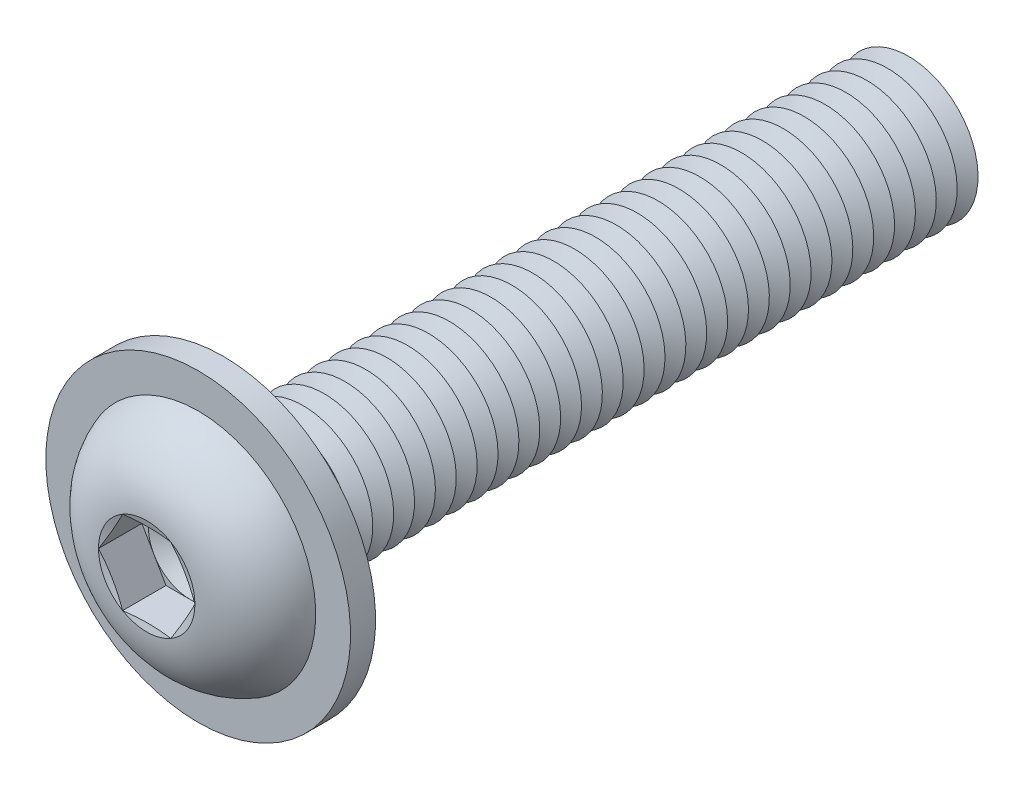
ISO-10303-21;
HEADER;
FILE_DESCRIPTION(('STEP AP214'),'2;1');
FILE_NAME('part.step','',(''),(''),'','','');
FILE_SCHEMA(('AUTOMOTIVE_DESIGN { 1 0 10303 214 1 1 1 1 }'));
ENDSEC;
DATA;
#1=APPLICATION_CONTEXT('core data for automotive mechanical design processes');
#2=APPLICATION_PROTOCOL_DEFINITION('international standard','automotive_design',2000,#1);
#3=PRODUCT_CONTEXT('',#1,'mechanical');
#4=PRODUCT('Part','Part','',(#3));
#5=PRODUCT_RELATED_PRODUCT_CATEGORY('part','',(#4));
#6=PRODUCT_DEFINITION_FORMATION('','',#4);
#7=PRODUCT_DEFINITION_CONTEXT('part definition',#1,'design');
#8=PRODUCT_DEFINITION('design','',#6,#7);
#9=PRODUCT_DEFINITION_SHAPE('','',#8);
#10=(LENGTH_UNIT() NAMED_UNIT(*) SI_UNIT(.MILLI.,.METRE.));
#11=(NAMED_UNIT(*) PLANE_ANGLE_UNIT() SI_UNIT($,.RADIAN.));
#12=(NAMED_UNIT(*) SI_UNIT($,.STERADIAN.) SOLID_ANGLE_UNIT());
#13=UNCERTAINTY_MEASURE_WITH_UNIT(LENGTH_MEASURE(1.E-05),#10,'distance_accuracy_value','');
#14=(GEOMETRIC_REPRESENTATION_CONTEXT(3) GLOBAL_UNCERTAINTY_ASSIGNED_CONTEXT((#13)) GLOBAL_UNIT_ASSIGNED_CONTEXT((#10,
#11,#12)) REPRESENTATION_CONTEXT('',''));
#15=CARTESIAN_POINT('',(0.,0.,0.));
#16=DIRECTION('',(0.,0.,1.));
#17=DIRECTION('',(1.,0.,0.));
#18=AXIS2_PLACEMENT_3D('',#15,#16,#17);
#19=CARTESIAN_POINT('',(0.,0.,-44.75));
#20=DIRECTION('',(0.,0.,1.));
#21=DIRECTION('',(0.,-1.,0.));
#22=AXIS2_PLACEMENT_3D('',#19,#20,#21);
#23=CONICAL_SURFACE('',#22,4.99999999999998,1.0471975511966);
#24=CARTESIAN_POINT('',(0.,0.,-45.5));
#25=DIRECTION('',(0.,0.,1.));
#26=DIRECTION('',(0.,-1.,0.));
#27=AXIS2_PLACEMENT_3D('',#24,#25,#26);
#28=CIRCLE('',#27,3.70096189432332);
#29=CARTESIAN_POINT('',(0.,-3.7009618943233,-45.5));
#30=VERTEX_POINT('',#29);
#31=EDGE_CURVE('E474',#30,#30,#28,.T.);
#32=ORIENTED_EDGE('',*,*,#31,.T.);
#33=EDGE_LOOP('',(#32));
#34=FACE_BOUND('',#33,.T.);
#35=CARTESIAN_POINT('',(0.,0.,-44.75));
#36=DIRECTION('',(0.,0.,1.));
#37=DIRECTION('',(0.,-1.,0.));
#38=AXIS2_PLACEMENT_3D('',#35,#36,#37);
#39=CIRCLE('',#38,4.99999999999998);
#40=CARTESIAN_POINT('',(0.,-4.99999999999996,-44.75));
#41=VERTEX_POINT('',#40);
#42=EDGE_CURVE('E477',#41,#41,#39,.T.);
#43=ORIENTED_EDGE('',*,*,#42,.F.);
#44=EDGE_LOOP('',(#43));
#45=FACE_BOUND('',#44,.T.);
#46=ADVANCED_FACE('F39',(#34,#45),#23,.T.);
#47=CARTESIAN_POINT('',(0.,0.,-45.5));
#48=DIRECTION('',(0.,0.,-1.));
#49=DIRECTION('',(0.,1.,0.));
#50=AXIS2_PLACEMENT_3D('',#47,#48,#49);
#51=CONICAL_SURFACE('',#50,3.70096189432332,1.0471975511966);
#52=CARTESIAN_POINT('',(0.,0.,-46.25));
#53=DIRECTION('',(0.,0.,1.));
#54=DIRECTION('',(0.,-1.,0.));
#55=AXIS2_PLACEMENT_3D('',#52,#53,#54);
#56=CIRCLE('',#55,4.99999999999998);
#57=CARTESIAN_POINT('',(0.,-4.99999999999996,-46.25));
#58=VERTEX_POINT('',#57);
#59=EDGE_CURVE('E476',#58,#58,#56,.T.);
#60=ORIENTED_EDGE('',*,*,#59,.T.);
#61=EDGE_LOOP('',(#60));
#62=FACE_BOUND('',#61,.T.);
#63=ORIENTED_EDGE('',*,*,#31,.F.);
#64=EDGE_LOOP('',(#63));
#65=FACE_BOUND('',#64,.T.);
#66=ADVANCED_FACE('F548',(#62,#65),#51,.T.);
#67=CARTESIAN_POINT('',(0.,4.99999999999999,-50.));
#68=DIRECTION('',(0.,0.,-1.));
#69=DIRECTION('',(0.,1.,0.));
#70=AXIS2_PLACEMENT_3D('',#67,#68,#69);
#71=PLANE('',#70);
#72=CARTESIAN_POINT('',(0.,0.,-50.));
#73=DIRECTION('',(0.,0.,1.));
#74=DIRECTION('',(0.,-1.,0.));
#75=AXIS2_PLACEMENT_3D('',#72,#73,#74);
#76=CIRCLE('',#75,3.70096189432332);
#77=CARTESIAN_POINT('',(0.,-3.7009618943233,-50.));
#78=VERTEX_POINT('',#77);
#79=EDGE_CURVE('E322',#78,#78,#76,.T.);
#80=ORIENTED_EDGE('',*,*,#79,.F.);
#81=EDGE_LOOP('',(#80));
#82=FACE_BOUND('',#81,.T.);
#83=ADVANCED_FACE('F546',(#82),#71,.T.);
#84=CARTESIAN_POINT('',(0.,0.,-49.25));
#85=DIRECTION('',(0.,0.,1.));
#86=DIRECTION('',(0.,-1.,0.));
#87=AXIS2_PLACEMENT_3D('',#84,#85,#86);
#88=CONICAL_SURFACE('',#87,4.99999999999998,1.0471975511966);
#89=ORIENTED_EDGE('',*,*,#79,.T.);
#90=EDGE_LOOP('',(#89));
#91=FACE_BOUND('',#90,.T.);
#92=CARTESIAN_POINT('',(0.,0.,-49.25));
#93=DIRECTION('',(0.,0.,1.));
#94=DIRECTION('',(0.,-1.,0.));
#95=AXIS2_PLACEMENT_3D('',#92,#93,#94);
#96=CIRCLE('',#95,4.99999999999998);
#97=CARTESIAN_POINT('',(0.,-4.99999999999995,-49.25));
#98=VERTEX_POINT('',#97);
#99=EDGE_CURVE('E495',#98,#98,#96,.T.);
#100=ORIENTED_EDGE('',*,*,#99,.F.);
#101=EDGE_LOOP('',(#100));
#102=FACE_BOUND('',#101,.T.);
#103=ADVANCED_FACE('F543',(#91,#102),#88,.T.);
#104=CARTESIAN_POINT('',(0.,0.,-48.5));
#105=DIRECTION('',(0.,0.,-1.));
#106=DIRECTION('',(0.,1.,0.));
#107=AXIS2_PLACEMENT_3D('',#104,#105,#106);
#108=CONICAL_SURFACE('',#107,3.70096189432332,1.0471975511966);
#109=ORIENTED_EDGE('',*,*,#99,.T.);
#110=EDGE_LOOP('',(#109));
#111=FACE_BOUND('',#110,.T.);
#112=CARTESIAN_POINT('',(0.,0.,-48.5));
#113=DIRECTION('',(0.,0.,1.));
#114=DIRECTION('',(0.,-1.,0.));
#115=AXIS2_PLACEMENT_3D('',#112,#113,#114);
#116=CIRCLE('',#115,3.70096189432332);
#117=CARTESIAN_POINT('',(0.,-3.7009618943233,-48.5));
#118=VERTEX_POINT('',#117);
#119=EDGE_CURVE('E498',#118,#118,#116,.T.);
#120=ORIENTED_EDGE('',*,*,#119,.F.);
#121=EDGE_LOOP('',(#120));
#122=FACE_BOUND('',#121,.T.);
#123=ADVANCED_FACE('F553',(#111,#122),#108,.T.);
#124=CARTESIAN_POINT('',(0.,0.,-47.75));
#125=DIRECTION('',(0.,0.,1.));
#126=DIRECTION('',(0.,-1.,0.));
#127=AXIS2_PLACEMENT_3D('',#124,#125,#126);
#128=CONICAL_SURFACE('',#127,4.99999999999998,1.0471975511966);
#129=ORIENTED_EDGE('',*,*,#119,.T.);
#130=EDGE_LOOP('',(#129));
#131=FACE_BOUND('',#130,.T.);
#132=CARTESIAN_POINT('',(0.,0.,-47.75));
#133=DIRECTION('',(0.,0.,1.));
#134=DIRECTION('',(0.,-1.,0.));
#135=AXIS2_PLACEMENT_3D('',#132,#133,#134);
#136=CIRCLE('',#135,4.99999999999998);
#137=CARTESIAN_POINT('',(0.,-4.99999999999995,-47.75));
#138=VERTEX_POINT('',#137);
#139=EDGE_CURVE('E513',#138,#138,#136,.T.);
#140=ORIENTED_EDGE('',*,*,#139,.F.);
#141=EDGE_LOOP('',(#140));
#142=FACE_BOUND('',#141,.T.);
#143=ADVANCED_FACE('F568',(#131,#142),#128,.T.);
#144=CARTESIAN_POINT('',(0.,0.,-47.));
#145=DIRECTION('',(0.,0.,-1.));
#146=DIRECTION('',(0.,1.,0.));
#147=AXIS2_PLACEMENT_3D('',#144,#145,#146);
#148=CONICAL_SURFACE('',#147,3.70096189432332,1.0471975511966);
#149=ORIENTED_EDGE('',*,*,#139,.T.);
#150=EDGE_LOOP('',(#149));
#151=FACE_BOUND('',#150,.T.);
#152=CARTESIAN_POINT('',(0.,0.,-47.));
#153=DIRECTION('',(0.,0.,1.));
#154=DIRECTION('',(0.,-1.,0.));
#155=AXIS2_PLACEMENT_3D('',#152,#153,#154);
#156=CIRCLE('',#155,3.70096189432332);
#157=CARTESIAN_POINT('',(0.,-3.7009618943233,-47.));
#158=VERTEX_POINT('',#157);
#159=EDGE_CURVE('E515',#158,#158,#156,.T.);
#160=ORIENTED_EDGE('',*,*,#159,.F.);
#161=EDGE_LOOP('',(#160));
#162=FACE_BOUND('',#161,.T.);
#163=ADVANCED_FACE('F564',(#151,#162),#148,.T.);
#164=CARTESIAN_POINT('',(0.,0.,-46.25));
#165=DIRECTION('',(0.,0.,1.));
#166=DIRECTION('',(0.,-1.,0.));
#167=AXIS2_PLACEMENT_3D('',#164,#165,#166);
#168=CONICAL_SURFACE('',#167,4.99999999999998,1.0471975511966);
#169=ORIENTED_EDGE('',*,*,#159,.T.);
#170=EDGE_LOOP('',(#169));
#171=FACE_BOUND('',#170,.T.);
#172=ORIENTED_EDGE('',*,*,#59,.F.);
#173=EDGE_LOOP('',(#172));
#174=FACE_BOUND('',#173,.T.);
#175=ADVANCED_FACE('F567',(#171,#174),#168,.T.);
#176=CARTESIAN_POINT('',(0.,0.,-43.25));
#177=DIRECTION('',(0.,0.,1.));
#178=DIRECTION('',(0.,-1.,0.));
#179=AXIS2_PLACEMENT_3D('',#176,#177,#178);
#180=CONICAL_SURFACE('',#179,4.99999999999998,1.0471975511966);
#181=CARTESIAN_POINT('',(0.,0.,-44.));
#182=DIRECTION('',(0.,0.,1.));
#183=DIRECTION('',(0.,-1.,0.));
#184=AXIS2_PLACEMENT_3D('',#181,#182,#183);
#185=CIRCLE('',#184,3.70096189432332);
#186=CARTESIAN_POINT('',(0.,-3.7009618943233,-44.));
#187=VERTEX_POINT('',#186);
#188=EDGE_CURVE('E348',#187,#187,#185,.T.);
#189=ORIENTED_EDGE('',*,*,#188,.T.);
#190=EDGE_LOOP('',(#189));
#191=FACE_BOUND('',#190,.T.);
#192=CARTESIAN_POINT('',(0.,0.,-43.25));
#193=DIRECTION('',(0.,0.,1.));
#194=DIRECTION('',(0.,-1.,0.));
#195=AXIS2_PLACEMENT_3D('',#192,#193,#194);
#196=CIRCLE('',#195,4.99999999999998);
#197=CARTESIAN_POINT('',(0.,-4.99999999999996,-43.25));
#198=VERTEX_POINT('',#197);
#199=EDGE_CURVE('E345',#198,#198,#196,.T.);
#200=ORIENTED_EDGE('',*,*,#199,.F.);
#201=EDGE_LOOP('',(#200));
#202=FACE_BOUND('',#201,.T.);
#203=ADVANCED_FACE('F572',(#191,#202),#180,.T.);
#204=CARTESIAN_POINT('',(0.,0.,-44.));
#205=DIRECTION('',(0.,0.,-1.));
#206=DIRECTION('',(0.,1.,0.));
#207=AXIS2_PLACEMENT_3D('',#204,#205,#206);
#208=CONICAL_SURFACE('',#207,3.70096189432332,1.0471975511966);
#209=ORIENTED_EDGE('',*,*,#42,.T.);
#210=EDGE_LOOP('',(#209));
#211=FACE_BOUND('',#210,.T.);
#212=ORIENTED_EDGE('',*,*,#188,.F.);
#213=EDGE_LOOP('',(#212));
#214=FACE_BOUND('',#213,.T.);
#215=ADVANCED_FACE('F601',(#211,#214),#208,.T.);
#216=CARTESIAN_POINT('',(0.,0.,-41.75));
#217=DIRECTION('',(0.,0.,1.));
#218=DIRECTION('',(0.,-1.,0.));
#219=AXIS2_PLACEMENT_3D('',#216,#217,#218);
#220=CONICAL_SURFACE('',#219,4.99999999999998,1.0471975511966);
#221=CARTESIAN_POINT('',(0.,0.,-42.5));
#222=DIRECTION('',(0.,0.,1.));
#223=DIRECTION('',(0.,-1.,0.));
#224=AXIS2_PLACEMENT_3D('',#221,#222,#223);
#225=CIRCLE('',#224,3.70096189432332);
#226=CARTESIAN_POINT('',(0.,-3.7009618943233,-42.5));
#227=VERTEX_POINT('',#226);
#228=EDGE_CURVE('E349',#227,#227,#225,.T.);
#229=ORIENTED_EDGE('',*,*,#228,.T.);
#230=EDGE_LOOP('',(#229));
#231=FACE_BOUND('',#230,.T.);
#232=CARTESIAN_POINT('',(0.,0.,-41.75));
#233=DIRECTION('',(0.,0.,1.));
#234=DIRECTION('',(0.,-1.,0.));
#235=AXIS2_PLACEMENT_3D('',#232,#233,#234);
#236=CIRCLE('',#235,4.99999999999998);
#237=CARTESIAN_POINT('',(0.,-4.99999999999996,-41.75));
#238=VERTEX_POINT('',#237);
#239=EDGE_CURVE('E1535',#238,#238,#236,.T.);
#240=ORIENTED_EDGE('',*,*,#239,.F.);
#241=EDGE_LOOP('',(#240));
#242=FACE_BOUND('',#241,.T.);
#243=ADVANCED_FACE('F607',(#231,#242),#220,.T.);
#244=CARTESIAN_POINT('',(0.,0.,-42.5));
#245=DIRECTION('',(0.,0.,-1.));
#246=DIRECTION('',(0.,1.,0.));
#247=AXIS2_PLACEMENT_3D('',#244,#245,#246);
#248=CONICAL_SURFACE('',#247,3.70096189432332,1.0471975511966);
#249=ORIENTED_EDGE('',*,*,#199,.T.);
#250=EDGE_LOOP('',(#249));
#251=FACE_BOUND('',#250,.T.);
#252=ORIENTED_EDGE('',*,*,#228,.F.);
#253=EDGE_LOOP('',(#252));
#254=FACE_BOUND('',#253,.T.);
#255=ADVANCED_FACE('F614',(#251,#254),#248,.T.);
#256=CARTESIAN_POINT('',(0.,0.,-40.25));
#257=DIRECTION('',(0.,0.,1.));
#258=DIRECTION('',(0.,-1.,0.));
#259=AXIS2_PLACEMENT_3D('',#256,#257,#258);
#260=CONICAL_SURFACE('',#259,4.99999999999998,1.0471975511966);
#261=CARTESIAN_POINT('',(0.,0.,-41.));
#262=DIRECTION('',(0.,0.,1.));
#263=DIRECTION('',(0.,-1.,0.));
#264=AXIS2_PLACEMENT_3D('',#261,#262,#263);
#265=CIRCLE('',#264,3.70096189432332);
#266=CARTESIAN_POINT('',(0.,-3.7009618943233,-41.));
#267=VERTEX_POINT('',#266);
#268=EDGE_CURVE('E1532',#267,#267,#265,.T.);
#269=ORIENTED_EDGE('',*,*,#268,.T.);
#270=EDGE_LOOP('',(#269));
#271=FACE_BOUND('',#270,.T.);
#272=CARTESIAN_POINT('',(0.,0.,-40.25));
#273=DIRECTION('',(0.,0.,1.));
#274=DIRECTION('',(0.,-1.,0.));
#275=AXIS2_PLACEMENT_3D('',#272,#273,#274);
#276=CIRCLE('',#275,4.99999999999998);
#277=CARTESIAN_POINT('',(0.,-4.99999999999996,-40.25));
#278=VERTEX_POINT('',#277);
#279=EDGE_CURVE('E1528',#278,#278,#276,.T.);
#280=ORIENTED_EDGE('',*,*,#279,.F.);
#281=EDGE_LOOP('',(#280));
#282=FACE_BOUND('',#281,.T.);
#283=ADVANCED_FACE('F621',(#271,#282),#260,.T.);
#284=CARTESIAN_POINT('',(0.,0.,-41.));
#285=DIRECTION('',(0.,0.,-1.));
#286=DIRECTION('',(0.,1.,0.));
#287=AXIS2_PLACEMENT_3D('',#284,#285,#286);
#288=CONICAL_SURFACE('',#287,3.70096189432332,1.0471975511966);
#289=ORIENTED_EDGE('',*,*,#239,.T.);
#290=EDGE_LOOP('',(#289));
#291=FACE_BOUND('',#290,.T.);
#292=ORIENTED_EDGE('',*,*,#268,.F.);
#293=EDGE_LOOP('',(#292));
#294=FACE_BOUND('',#293,.T.);
#295=ADVANCED_FACE('F628',(#291,#294),#288,.T.);
#296=CARTESIAN_POINT('',(0.,0.,-38.75));
#297=DIRECTION('',(0.,0.,1.));
#298=DIRECTION('',(0.,-1.,0.));
#299=AXIS2_PLACEMENT_3D('',#296,#297,#298);
#300=CONICAL_SURFACE('',#299,4.99999999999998,1.0471975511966);
#301=CARTESIAN_POINT('',(0.,0.,-39.5));
#302=DIRECTION('',(0.,0.,1.));
#303=DIRECTION('',(0.,-1.,0.));
#304=AXIS2_PLACEMENT_3D('',#301,#302,#303);
#305=CIRCLE('',#304,3.70096189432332);
#306=CARTESIAN_POINT('',(0.,-3.7009618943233,-39.5));
#307=VERTEX_POINT('',#306);
#308=EDGE_CURVE('E354',#307,#307,#305,.T.);
#309=ORIENTED_EDGE('',*,*,#308,.T.);
#310=EDGE_LOOP('',(#309));
#311=FACE_BOUND('',#310,.T.);
#312=CARTESIAN_POINT('',(0.,0.,-38.75));
#313=DIRECTION('',(0.,0.,1.));
#314=DIRECTION('',(0.,-1.,0.));
#315=AXIS2_PLACEMENT_3D('',#312,#313,#314);
#316=CIRCLE('',#315,4.99999999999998);
#317=CARTESIAN_POINT('',(0.,-4.99999999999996,-38.75));
#318=VERTEX_POINT('',#317);
#319=EDGE_CURVE('E351',#318,#318,#316,.T.);
#320=ORIENTED_EDGE('',*,*,#319,.F.);
#321=EDGE_LOOP('',(#320));
#322=FACE_BOUND('',#321,.T.);
#323=ADVANCED_FACE('F635',(#311,#322),#300,.T.);
#324=CARTESIAN_POINT('',(0.,0.,-39.5));
#325=DIRECTION('',(0.,0.,-1.));
#326=DIRECTION('',(0.,1.,0.));
#327=AXIS2_PLACEMENT_3D('',#324,#325,#326);
#328=CONICAL_SURFACE('',#327,3.70096189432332,1.0471975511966);
#329=ORIENTED_EDGE('',*,*,#279,.T.);
#330=EDGE_LOOP('',(#329));
#331=FACE_BOUND('',#330,.T.);
#332=ORIENTED_EDGE('',*,*,#308,.F.);
#333=EDGE_LOOP('',(#332));
#334=FACE_BOUND('',#333,.T.);
#335=ADVANCED_FACE('F642',(#331,#334),#328,.T.);
#336=CARTESIAN_POINT('',(0.,0.,-37.25));
#337=DIRECTION('',(0.,0.,1.));
#338=DIRECTION('',(0.,-1.,0.));
#339=AXIS2_PLACEMENT_3D('',#336,#337,#338);
#340=CONICAL_SURFACE('',#339,4.99999999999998,1.0471975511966);
#341=CARTESIAN_POINT('',(0.,0.,-38.));
#342=DIRECTION('',(0.,0.,1.));
#343=DIRECTION('',(0.,-1.,0.));
#344=AXIS2_PLACEMENT_3D('',#341,#342,#343);
#345=CIRCLE('',#344,3.70096189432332);
#346=CARTESIAN_POINT('',(0.,-3.7009618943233,-38.));
#347=VERTEX_POINT('',#346);
#348=EDGE_CURVE('E355',#347,#347,#345,.T.);
#349=ORIENTED_EDGE('',*,*,#348,.T.);
#350=EDGE_LOOP('',(#349));
#351=FACE_BOUND('',#350,.T.);
#352=CARTESIAN_POINT('',(0.,0.,-37.25));
#353=DIRECTION('',(0.,0.,1.));
#354=DIRECTION('',(0.,-1.,0.));
#355=AXIS2_PLACEMENT_3D('',#352,#353,#354);
#356=CIRCLE('',#355,4.99999999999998);
#357=CARTESIAN_POINT('',(0.,-4.99999999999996,-37.25));
#358=VERTEX_POINT('',#357);
#359=EDGE_CURVE('E455',#358,#358,#356,.T.);
#360=ORIENTED_EDGE('',*,*,#359,.F.);
#361=EDGE_LOOP('',(#360));
#362=FACE_BOUND('',#361,.T.);
#363=ADVANCED_FACE('F649',(#351,#362),#340,.T.);
#364=CARTESIAN_POINT('',(0.,0.,-38.));
#365=DIRECTION('',(0.,0.,-1.));
#366=DIRECTION('',(0.,1.,0.));
#367=AXIS2_PLACEMENT_3D('',#364,#365,#366);
#368=CONICAL_SURFACE('',#367,3.70096189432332,1.0471975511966);
#369=ORIENTED_EDGE('',*,*,#319,.T.);
#370=EDGE_LOOP('',(#369));
#371=FACE_BOUND('',#370,.T.);
#372=ORIENTED_EDGE('',*,*,#348,.F.);
#373=EDGE_LOOP('',(#372));
#374=FACE_BOUND('',#373,.T.);
#375=ADVANCED_FACE('F656',(#371,#374),#368,.T.);
#376=CARTESIAN_POINT('',(0.,0.,-35.75));
#377=DIRECTION('',(0.,0.,1.));
#378=DIRECTION('',(0.,-1.,0.));
#379=AXIS2_PLACEMENT_3D('',#376,#377,#378);
#380=CONICAL_SURFACE('',#379,4.99999999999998,1.0471975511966);
#381=CARTESIAN_POINT('',(0.,0.,-36.5));
#382=DIRECTION('',(0.,0.,1.));
#383=DIRECTION('',(0.,-1.,0.));
#384=AXIS2_PLACEMENT_3D('',#381,#382,#383);
#385=CIRCLE('',#384,3.70096189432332);
#386=CARTESIAN_POINT('',(0.,-3.7009618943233,-36.5));
#387=VERTEX_POINT('',#386);
#388=EDGE_CURVE('E453',#387,#387,#385,.T.);
#389=ORIENTED_EDGE('',*,*,#388,.T.);
#390=EDGE_LOOP('',(#389));
#391=FACE_BOUND('',#390,.T.);
#392=CARTESIAN_POINT('',(0.,0.,-35.75));
#393=DIRECTION('',(0.,0.,1.));
#394=DIRECTION('',(0.,-1.,0.));
#395=AXIS2_PLACEMENT_3D('',#392,#393,#394);
#396=CIRCLE('',#395,4.99999999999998);
#397=CARTESIAN_POINT('',(0.,-4.99999999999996,-35.75));
#398=VERTEX_POINT('',#397);
#399=EDGE_CURVE('E456',#398,#398,#396,.T.);
#400=ORIENTED_EDGE('',*,*,#399,.F.);
#401=EDGE_LOOP('',(#400));
#402=FACE_BOUND('',#401,.T.);
#403=ADVANCED_FACE('F663',(#391,#402),#380,.T.);
#404=CARTESIAN_POINT('',(0.,0.,-36.5));
#405=DIRECTION('',(0.,0.,-1.));
#406=DIRECTION('',(0.,1.,0.));
#407=AXIS2_PLACEMENT_3D('',#404,#405,#406);
#408=CONICAL_SURFACE('',#407,3.70096189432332,1.0471975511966);
#409=ORIENTED_EDGE('',*,*,#359,.T.);
#410=EDGE_LOOP('',(#409));
#411=FACE_BOUND('',#410,.T.);
#412=ORIENTED_EDGE('',*,*,#388,.F.);
#413=EDGE_LOOP('',(#412));
#414=FACE_BOUND('',#413,.T.);
#415=ADVANCED_FACE('F670',(#411,#414),#408,.T.);
#416=CARTESIAN_POINT('',(0.,0.,-34.25));
#417=DIRECTION('',(0.,0.,1.));
#418=DIRECTION('',(0.,-1.,0.));
#419=AXIS2_PLACEMENT_3D('',#416,#417,#418);
#420=CONICAL_SURFACE('',#419,4.99999999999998,1.0471975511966);
#421=CARTESIAN_POINT('',(0.,0.,-35.));
#422=DIRECTION('',(0.,0.,1.));
#423=DIRECTION('',(0.,-1.,0.));
#424=AXIS2_PLACEMENT_3D('',#421,#422,#423);
#425=CIRCLE('',#424,3.70096189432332);
#426=CARTESIAN_POINT('',(0.,-3.7009618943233,-35.));
#427=VERTEX_POINT('',#426);
#428=EDGE_CURVE('E1515',#427,#427,#425,.T.);
#429=ORIENTED_EDGE('',*,*,#428,.T.);
#430=EDGE_LOOP('',(#429));
#431=FACE_BOUND('',#430,.T.);
#432=CARTESIAN_POINT('',(0.,0.,-34.25));
#433=DIRECTION('',(0.,0.,1.));
#434=DIRECTION('',(0.,-1.,0.));
#435=AXIS2_PLACEMENT_3D('',#432,#433,#434);
#436=CIRCLE('',#435,4.99999999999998);
#437=CARTESIAN_POINT('',(0.,-4.99999999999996,-34.25));
#438=VERTEX_POINT('',#437);
#439=EDGE_CURVE('E329',#438,#438,#436,.T.);
#440=ORIENTED_EDGE('',*,*,#439,.F.);
#441=EDGE_LOOP('',(#440));
#442=FACE_BOUND('',#441,.T.);
#443=ADVANCED_FACE('F677',(#431,#442),#420,.T.);
#444=CARTESIAN_POINT('',(0.,0.,-35.));
#445=DIRECTION('',(0.,0.,-1.));
#446=DIRECTION('',(0.,1.,0.));
#447=AXIS2_PLACEMENT_3D('',#444,#445,#446);
#448=CONICAL_SURFACE('',#447,3.70096189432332,1.0471975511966);
#449=ORIENTED_EDGE('',*,*,#399,.T.);
#450=EDGE_LOOP('',(#449));
#451=FACE_BOUND('',#450,.T.);
#452=ORIENTED_EDGE('',*,*,#428,.F.);
#453=EDGE_LOOP('',(#452));
#454=FACE_BOUND('',#453,.T.);
#455=ADVANCED_FACE('F684',(#451,#454),#448,.T.);
#456=CARTESIAN_POINT('',(0.,0.,-32.75));
#457=DIRECTION('',(0.,0.,1.));
#458=DIRECTION('',(0.,-1.,0.));
#459=AXIS2_PLACEMENT_3D('',#456,#457,#458);
#460=CONICAL_SURFACE('',#459,4.99999999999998,1.0471975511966);
#461=CARTESIAN_POINT('',(0.,0.,-33.5));
#462=DIRECTION('',(0.,0.,1.));
#463=DIRECTION('',(0.,-1.,0.));
#464=AXIS2_PLACEMENT_3D('',#461,#462,#463);
#465=CIRCLE('',#464,3.70096189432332);
#466=CARTESIAN_POINT('',(0.,-3.7009618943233,-33.5));
#467=VERTEX_POINT('',#466);
#468=EDGE_CURVE('E326',#467,#467,#465,.T.);
#469=ORIENTED_EDGE('',*,*,#468,.T.);
#470=EDGE_LOOP('',(#469));
#471=FACE_BOUND('',#470,.T.);
#472=CARTESIAN_POINT('',(0.,0.,-32.75));
#473=DIRECTION('',(0.,0.,1.));
#474=DIRECTION('',(0.,-1.,0.));
#475=AXIS2_PLACEMENT_3D('',#472,#473,#474);
#476=CIRCLE('',#475,4.99999999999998);
#477=CARTESIAN_POINT('',(0.,-4.99999999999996,-32.75));
#478=VERTEX_POINT('',#477);
#479=EDGE_CURVE('E330',#478,#478,#476,.T.);
#480=ORIENTED_EDGE('',*,*,#479,.F.);
#481=EDGE_LOOP('',(#480));
#482=FACE_BOUND('',#481,.T.);
#483=ADVANCED_FACE('F691',(#471,#482),#460,.T.);
#484=CARTESIAN_POINT('',(0.,0.,-33.5));
#485=DIRECTION('',(0.,0.,-1.));
#486=DIRECTION('',(0.,1.,0.));
#487=AXIS2_PLACEMENT_3D('',#484,#485,#486);
#488=CONICAL_SURFACE('',#487,3.70096189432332,1.0471975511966);
#489=ORIENTED_EDGE('',*,*,#439,.T.);
#490=EDGE_LOOP('',(#489));
#491=FACE_BOUND('',#490,.T.);
#492=ORIENTED_EDGE('',*,*,#468,.F.);
#493=EDGE_LOOP('',(#492));
#494=FACE_BOUND('',#493,.T.);
#495=ADVANCED_FACE('F698',(#491,#494),#488,.T.);
#496=CARTESIAN_POINT('',(0.,0.,-31.25));
#497=DIRECTION('',(0.,0.,1.));
#498=DIRECTION('',(0.,-1.,0.));
#499=AXIS2_PLACEMENT_3D('',#496,#497,#498);
#500=CONICAL_SURFACE('',#499,4.99999999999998,1.0471975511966);
#501=CARTESIAN_POINT('',(0.,0.,-32.));
#502=DIRECTION('',(0.,0.,1.));
#503=DIRECTION('',(0.,-1.,0.));
#504=AXIS2_PLACEMENT_3D('',#501,#502,#503);
#505=CIRCLE('',#504,3.70096189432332);
#506=CARTESIAN_POINT('',(0.,-3.7009618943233,-32.));
#507=VERTEX_POINT('',#506);
#508=EDGE_CURVE('E1503',#507,#507,#505,.T.);
#509=ORIENTED_EDGE('',*,*,#508,.T.);
#510=EDGE_LOOP('',(#509));
#511=FACE_BOUND('',#510,.T.);
#512=CARTESIAN_POINT('',(0.,0.,-31.25));
#513=DIRECTION('',(0.,0.,1.));
#514=DIRECTION('',(0.,-1.,0.));
#515=AXIS2_PLACEMENT_3D('',#512,#513,#514);
#516=CIRCLE('',#515,4.99999999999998);
#517=CARTESIAN_POINT('',(0.,-4.99999999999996,-31.25));
#518=VERTEX_POINT('',#517);
#519=EDGE_CURVE('E1498',#518,#518,#516,.T.);
#520=ORIENTED_EDGE('',*,*,#519,.F.);
#521=EDGE_LOOP('',(#520));
#522=FACE_BOUND('',#521,.T.);
#523=ADVANCED_FACE('F705',(#511,#522),#500,.T.);
#524=CARTESIAN_POINT('',(0.,0.,-32.));
#525=DIRECTION('',(0.,0.,-1.));
#526=DIRECTION('',(0.,1.,0.));
#527=AXIS2_PLACEMENT_3D('',#524,#525,#526);
#528=CONICAL_SURFACE('',#527,3.70096189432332,1.0471975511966);
#529=ORIENTED_EDGE('',*,*,#479,.T.);
#530=EDGE_LOOP('',(#529));
#531=FACE_BOUND('',#530,.T.);
#532=ORIENTED_EDGE('',*,*,#508,.F.);
#533=EDGE_LOOP('',(#532));
#534=FACE_BOUND('',#533,.T.);
#535=ADVANCED_FACE('F712',(#531,#534),#528,.T.);
#536=CARTESIAN_POINT('',(0.,0.,-29.75));
#537=DIRECTION('',(0.,0.,1.));
#538=DIRECTION('',(0.,-1.,0.));
#539=AXIS2_PLACEMENT_3D('',#536,#537,#538);
#540=CONICAL_SURFACE('',#539,4.99999999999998,1.0471975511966);
#541=CARTESIAN_POINT('',(0.,0.,-30.5));
#542=DIRECTION('',(0.,0.,1.));
#543=DIRECTION('',(0.,-1.,0.));
#544=AXIS2_PLACEMENT_3D('',#541,#542,#543);
#545=CIRCLE('',#544,3.70096189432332);
#546=CARTESIAN_POINT('',(0.,-3.70096189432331,-30.5));
#547=VERTEX_POINT('',#546);
#548=EDGE_CURVE('E335',#547,#547,#545,.T.);
#549=ORIENTED_EDGE('',*,*,#548,.T.);
#550=EDGE_LOOP('',(#549));
#551=FACE_BOUND('',#550,.T.);
#552=CARTESIAN_POINT('',(0.,0.,-29.75));
#553=DIRECTION('',(0.,0.,1.));
#554=DIRECTION('',(0.,-1.,0.));
#555=AXIS2_PLACEMENT_3D('',#552,#553,#554);
#556=CIRCLE('',#555,4.99999999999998);
#557=CARTESIAN_POINT('',(0.,-4.99999999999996,-29.75));
#558=VERTEX_POINT('',#557);
#559=EDGE_CURVE('E332',#558,#558,#556,.T.);
#560=ORIENTED_EDGE('',*,*,#559,.F.);
#561=EDGE_LOOP('',(#560));
#562=FACE_BOUND('',#561,.T.);
#563=ADVANCED_FACE('F719',(#551,#562),#540,.T.);
#564=CARTESIAN_POINT('',(0.,0.,-30.5));
#565=DIRECTION('',(0.,0.,-1.));
#566=DIRECTION('',(0.,1.,0.));
#567=AXIS2_PLACEMENT_3D('',#564,#565,#566);
#568=CONICAL_SURFACE('',#567,3.70096189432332,1.0471975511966);
#569=ORIENTED_EDGE('',*,*,#519,.T.);
#570=EDGE_LOOP('',(#569));
#571=FACE_BOUND('',#570,.T.);
#572=ORIENTED_EDGE('',*,*,#548,.F.);
#573=EDGE_LOOP('',(#572));
#574=FACE_BOUND('',#573,.T.);
#575=ADVANCED_FACE('F726',(#571,#574),#568,.T.);
#576=CARTESIAN_POINT('',(0.,0.,-28.25));
#577=DIRECTION('',(0.,0.,1.));
#578=DIRECTION('',(0.,-1.,0.));
#579=AXIS2_PLACEMENT_3D('',#576,#577,#578);
#580=CONICAL_SURFACE('',#579,4.99999999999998,1.0471975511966);
#581=CARTESIAN_POINT('',(0.,0.,-29.));
#582=DIRECTION('',(0.,0.,1.));
#583=DIRECTION('',(0.,-1.,0.));
#584=AXIS2_PLACEMENT_3D('',#581,#582,#583);
#585=CIRCLE('',#584,3.70096189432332);
#586=CARTESIAN_POINT('',(0.,-3.70096189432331,-29.));
#587=VERTEX_POINT('',#586);
#588=EDGE_CURVE('E336',#587,#587,#585,.T.);
#589=ORIENTED_EDGE('',*,*,#588,.T.);
#590=EDGE_LOOP('',(#589));
#591=FACE_BOUND('',#590,.T.);
#592=CARTESIAN_POINT('',(0.,0.,-28.25));
#593=DIRECTION('',(0.,0.,1.));
#594=DIRECTION('',(0.,-1.,0.));
#595=AXIS2_PLACEMENT_3D('',#592,#593,#594);
#596=CIRCLE('',#595,4.99999999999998);
#597=CARTESIAN_POINT('',(0.,-4.99999999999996,-28.25));
#598=VERTEX_POINT('',#597);
#599=EDGE_CURVE('E487',#598,#598,#596,.T.);
#600=ORIENTED_EDGE('',*,*,#599,.F.);
#601=EDGE_LOOP('',(#600));
#602=FACE_BOUND('',#601,.T.);
#603=ADVANCED_FACE('F733',(#591,#602),#580,.T.);
#604=CARTESIAN_POINT('',(0.,0.,-29.));
#605=DIRECTION('',(0.,0.,-1.));
#606=DIRECTION('',(0.,1.,0.));
#607=AXIS2_PLACEMENT_3D('',#604,#605,#606);
#608=CONICAL_SURFACE('',#607,3.70096189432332,1.0471975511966);
#609=ORIENTED_EDGE('',*,*,#559,.T.);
#610=EDGE_LOOP('',(#609));
#611=FACE_BOUND('',#610,.T.);
#612=ORIENTED_EDGE('',*,*,#588,.F.);
#613=EDGE_LOOP('',(#612));
#614=FACE_BOUND('',#613,.T.);
#615=ADVANCED_FACE('F740',(#611,#614),#608,.T.);
#616=CARTESIAN_POINT('',(0.,0.,-26.75));
#617=DIRECTION('',(0.,0.,1.));
#618=DIRECTION('',(0.,-1.,0.));
#619=AXIS2_PLACEMENT_3D('',#616,#617,#618);
#620=CONICAL_SURFACE('',#619,4.99999999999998,1.0471975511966);
#621=CARTESIAN_POINT('',(0.,0.,-27.5));
#622=DIRECTION('',(0.,0.,1.));
#623=DIRECTION('',(0.,-1.,0.));
#624=AXIS2_PLACEMENT_3D('',#621,#622,#623);
#625=CIRCLE('',#624,3.70096189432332);
#626=CARTESIAN_POINT('',(0.,-3.70096189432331,-27.5));
#627=VERTEX_POINT('',#626);
#628=EDGE_CURVE('E490',#627,#627,#625,.T.);
#629=ORIENTED_EDGE('',*,*,#628,.T.);
#630=EDGE_LOOP('',(#629));
#631=FACE_BOUND('',#630,.T.);
#632=CARTESIAN_POINT('',(0.,0.,-26.75));
#633=DIRECTION('',(0.,0.,1.));
#634=DIRECTION('',(0.,-1.,0.));
#635=AXIS2_PLACEMENT_3D('',#632,#633,#634);
#636=CIRCLE('',#635,4.99999999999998);
#637=CARTESIAN_POINT('',(0.,-4.99999999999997,-26.75));
#638=VERTEX_POINT('',#637);
#639=EDGE_CURVE('E451',#638,#638,#636,.T.);
#640=ORIENTED_EDGE('',*,*,#639,.F.);
#641=EDGE_LOOP('',(#640));
#642=FACE_BOUND('',#641,.T.);
#643=ADVANCED_FACE('F747',(#631,#642),#620,.T.);
#644=CARTESIAN_POINT('',(0.,0.,-27.5));
#645=DIRECTION('',(0.,0.,-1.));
#646=DIRECTION('',(0.,1.,0.));
#647=AXIS2_PLACEMENT_3D('',#644,#645,#646);
#648=CONICAL_SURFACE('',#647,3.70096189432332,1.0471975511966);
#649=ORIENTED_EDGE('',*,*,#599,.T.);
#650=EDGE_LOOP('',(#649));
#651=FACE_BOUND('',#650,.T.);
#652=ORIENTED_EDGE('',*,*,#628,.F.);
#653=EDGE_LOOP('',(#652));
#654=FACE_BOUND('',#653,.T.);
#655=ADVANCED_FACE('F754',(#651,#654),#648,.T.);
#656=CARTESIAN_POINT('',(0.,0.,-25.25));
#657=DIRECTION('',(0.,0.,1.));
#658=DIRECTION('',(0.,-1.,0.));
#659=AXIS2_PLACEMENT_3D('',#656,#657,#658);
#660=CONICAL_SURFACE('',#659,4.99999999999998,1.0471975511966);
#661=CARTESIAN_POINT('',(0.,0.,-26.));
#662=DIRECTION('',(0.,0.,1.));
#663=DIRECTION('',(0.,-1.,0.));
#664=AXIS2_PLACEMENT_3D('',#661,#662,#663);
#665=CIRCLE('',#664,3.70096189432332);
#666=CARTESIAN_POINT('',(0.,-3.70096189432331,-26.));
#667=VERTEX_POINT('',#666);
#668=EDGE_CURVE('E448',#667,#667,#665,.T.);
#669=ORIENTED_EDGE('',*,*,#668,.T.);
#670=EDGE_LOOP('',(#669));
#671=FACE_BOUND('',#670,.T.);
#672=CARTESIAN_POINT('',(0.,0.,-25.25));
#673=DIRECTION('',(0.,0.,1.));
#674=DIRECTION('',(0.,-1.,0.));
#675=AXIS2_PLACEMENT_3D('',#672,#673,#674);
#676=CIRCLE('',#675,4.99999999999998);
#677=CARTESIAN_POINT('',(0.,-4.99999999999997,-25.25));
#678=VERTEX_POINT('',#677);
#679=EDGE_CURVE('E360',#678,#678,#676,.T.);
#680=ORIENTED_EDGE('',*,*,#679,.F.);
#681=EDGE_LOOP('',(#680));
#682=FACE_BOUND('',#681,.T.);
#683=ADVANCED_FACE('F761',(#671,#682),#660,.T.);
#684=CARTESIAN_POINT('',(0.,0.,-26.));
#685=DIRECTION('',(0.,0.,-1.));
#686=DIRECTION('',(0.,1.,0.));
#687=AXIS2_PLACEMENT_3D('',#684,#685,#686);
#688=CONICAL_SURFACE('',#687,3.70096189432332,1.0471975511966);
#689=ORIENTED_EDGE('',*,*,#639,.T.);
#690=EDGE_LOOP('',(#689));
#691=FACE_BOUND('',#690,.T.);
#692=ORIENTED_EDGE('',*,*,#668,.F.);
#693=EDGE_LOOP('',(#692));
#694=FACE_BOUND('',#693,.T.);
#695=ADVANCED_FACE('F768',(#691,#694),#688,.T.);
#696=CARTESIAN_POINT('',(0.,0.,-23.75));
#697=DIRECTION('',(0.,0.,1.));
#698=DIRECTION('',(0.,-1.,0.));
#699=AXIS2_PLACEMENT_3D('',#696,#697,#698);
#700=CONICAL_SURFACE('',#699,4.99999999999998,1.0471975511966);
#701=CARTESIAN_POINT('',(0.,0.,-24.5));
#702=DIRECTION('',(0.,0.,1.));
#703=DIRECTION('',(0.,-1.,0.));
#704=AXIS2_PLACEMENT_3D('',#701,#702,#703);
#705=CIRCLE('',#704,3.70096189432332);
#706=CARTESIAN_POINT('',(0.,-3.70096189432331,-24.5));
#707=VERTEX_POINT('',#706);
#708=EDGE_CURVE('E357',#707,#707,#705,.T.);
#709=ORIENTED_EDGE('',*,*,#708,.T.);
#710=EDGE_LOOP('',(#709));
#711=FACE_BOUND('',#710,.T.);
#712=CARTESIAN_POINT('',(0.,0.,-23.75));
#713=DIRECTION('',(0.,0.,1.));
#714=DIRECTION('',(0.,-1.,0.));
#715=AXIS2_PLACEMENT_3D('',#712,#713,#714);
#716=CIRCLE('',#715,4.99999999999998);
#717=CARTESIAN_POINT('',(0.,-4.99999999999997,-23.75));
#718=VERTEX_POINT('',#717);
#719=EDGE_CURVE('E361',#718,#718,#716,.T.);
#720=ORIENTED_EDGE('',*,*,#719,.F.);
#721=EDGE_LOOP('',(#720));
#722=FACE_BOUND('',#721,.T.);
#723=ADVANCED_FACE('F775',(#711,#722),#700,.T.);
#724=CARTESIAN_POINT('',(0.,0.,-24.5));
#725=DIRECTION('',(0.,0.,-1.));
#726=DIRECTION('',(0.,1.,0.));
#727=AXIS2_PLACEMENT_3D('',#724,#725,#726);
#728=CONICAL_SURFACE('',#727,3.70096189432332,1.0471975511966);
#729=ORIENTED_EDGE('',*,*,#679,.T.);
#730=EDGE_LOOP('',(#729));
#731=FACE_BOUND('',#730,.T.);
#732=ORIENTED_EDGE('',*,*,#708,.F.);
#733=EDGE_LOOP('',(#732));
#734=FACE_BOUND('',#733,.T.);
#735=ADVANCED_FACE('F782',(#731,#734),#728,.T.);
#736=CARTESIAN_POINT('',(0.,0.,-22.25));
#737=DIRECTION('',(0.,0.,1.));
#738=DIRECTION('',(0.,-1.,0.));
#739=AXIS2_PLACEMENT_3D('',#736,#737,#738);
#740=CONICAL_SURFACE('',#739,4.99999999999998,1.0471975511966);
#741=CARTESIAN_POINT('',(0.,0.,-23.));
#742=DIRECTION('',(0.,0.,1.));
#743=DIRECTION('',(0.,-1.,0.));
#744=AXIS2_PLACEMENT_3D('',#741,#742,#743);
#745=CIRCLE('',#744,3.70096189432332);
#746=CARTESIAN_POINT('',(0.,-3.70096189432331,-23.));
#747=VERTEX_POINT('',#746);
#748=EDGE_CURVE('E366',#747,#747,#745,.T.);
#749=ORIENTED_EDGE('',*,*,#748,.T.);
#750=EDGE_LOOP('',(#749));
#751=FACE_BOUND('',#750,.T.);
#752=CARTESIAN_POINT('',(0.,0.,-22.25));
#753=DIRECTION('',(0.,0.,1.));
#754=DIRECTION('',(0.,-1.,0.));
#755=AXIS2_PLACEMENT_3D('',#752,#753,#754);
#756=CIRCLE('',#755,4.99999999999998);
#757=CARTESIAN_POINT('',(0.,-4.99999999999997,-22.25));
#758=VERTEX_POINT('',#757);
#759=EDGE_CURVE('E370',#758,#758,#756,.T.);
#760=ORIENTED_EDGE('',*,*,#759,.F.);
#761=EDGE_LOOP('',(#760));
#762=FACE_BOUND('',#761,.T.);
#763=ADVANCED_FACE('F789',(#751,#762),#740,.T.);
#764=CARTESIAN_POINT('',(0.,0.,-23.));
#765=DIRECTION('',(0.,0.,-1.));
#766=DIRECTION('',(0.,1.,0.));
#767=AXIS2_PLACEMENT_3D('',#764,#765,#766);
#768=CONICAL_SURFACE('',#767,3.70096189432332,1.0471975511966);
#769=ORIENTED_EDGE('',*,*,#719,.T.);
#770=EDGE_LOOP('',(#769));
#771=FACE_BOUND('',#770,.T.);
#772=ORIENTED_EDGE('',*,*,#748,.F.);
#773=EDGE_LOOP('',(#772));
#774=FACE_BOUND('',#773,.T.);
#775=ADVANCED_FACE('F796',(#771,#774),#768,.T.);
#776=CARTESIAN_POINT('',(0.,0.,-20.75));
#777=DIRECTION('',(0.,0.,1.));
#778=DIRECTION('',(0.,-1.,0.));
#779=AXIS2_PLACEMENT_3D('',#776,#777,#778);
#780=CONICAL_SURFACE('',#779,4.99999999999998,1.0471975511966);
#781=CARTESIAN_POINT('',(0.,0.,-21.5));
#782=DIRECTION('',(0.,0.,1.));
#783=DIRECTION('',(0.,-1.,0.));
#784=AXIS2_PLACEMENT_3D('',#781,#782,#783);
#785=CIRCLE('',#784,3.70096189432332);
#786=CARTESIAN_POINT('',(0.,-3.70096189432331,-21.5));
#787=VERTEX_POINT('',#786);
#788=EDGE_CURVE('E445',#787,#787,#785,.T.);
#789=ORIENTED_EDGE('',*,*,#788,.T.);
#790=EDGE_LOOP('',(#789));
#791=FACE_BOUND('',#790,.T.);
#792=CARTESIAN_POINT('',(0.,0.,-20.75));
#793=DIRECTION('',(0.,0.,1.));
#794=DIRECTION('',(0.,-1.,0.));
#795=AXIS2_PLACEMENT_3D('',#792,#793,#794);
#796=CIRCLE('',#795,4.99999999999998);
#797=CARTESIAN_POINT('',(0.,-4.99999999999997,-20.75));
#798=VERTEX_POINT('',#797);
#799=EDGE_CURVE('E442',#798,#798,#796,.T.);
#800=ORIENTED_EDGE('',*,*,#799,.F.);
#801=EDGE_LOOP('',(#800));
#802=FACE_BOUND('',#801,.T.);
#803=ADVANCED_FACE('F803',(#791,#802),#780,.T.);
#804=CARTESIAN_POINT('',(0.,0.,-21.5));
#805=DIRECTION('',(0.,0.,-1.));
#806=DIRECTION('',(0.,1.,0.));
#807=AXIS2_PLACEMENT_3D('',#804,#805,#806);
#808=CONICAL_SURFACE('',#807,3.70096189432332,1.0471975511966);
#809=ORIENTED_EDGE('',*,*,#759,.T.);
#810=EDGE_LOOP('',(#809));
#811=FACE_BOUND('',#810,.T.);
#812=ORIENTED_EDGE('',*,*,#788,.F.);
#813=EDGE_LOOP('',(#812));
#814=FACE_BOUND('',#813,.T.);
#815=ADVANCED_FACE('F810',(#811,#814),#808,.T.);
#816=CARTESIAN_POINT('',(0.,0.,-19.25));
#817=DIRECTION('',(0.,0.,1.));
#818=DIRECTION('',(0.,-1.,0.));
#819=AXIS2_PLACEMENT_3D('',#816,#817,#818);
#820=CONICAL_SURFACE('',#819,4.99999999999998,1.0471975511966);
#821=CARTESIAN_POINT('',(0.,0.,-20.));
#822=DIRECTION('',(0.,0.,1.));
#823=DIRECTION('',(0.,-1.,0.));
#824=AXIS2_PLACEMENT_3D('',#821,#822,#823);
#825=CIRCLE('',#824,3.70096189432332);
#826=CARTESIAN_POINT('',(0.,-3.70096189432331,-20.));
#827=VERTEX_POINT('',#826);
#828=EDGE_CURVE('E446',#827,#827,#825,.T.);
#829=ORIENTED_EDGE('',*,*,#828,.T.);
#830=EDGE_LOOP('',(#829));
#831=FACE_BOUND('',#830,.T.);
#832=CARTESIAN_POINT('',(0.,0.,-19.25));
#833=DIRECTION('',(0.,0.,1.));
#834=DIRECTION('',(0.,-1.,0.));
#835=AXIS2_PLACEMENT_3D('',#832,#833,#834);
#836=CIRCLE('',#835,4.99999999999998);
#837=CARTESIAN_POINT('',(0.,-4.99999999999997,-19.25));
#838=VERTEX_POINT('',#837);
#839=EDGE_CURVE('E468',#838,#838,#836,.T.);
#840=ORIENTED_EDGE('',*,*,#839,.F.);
#841=EDGE_LOOP('',(#840));
#842=FACE_BOUND('',#841,.T.);
#843=ADVANCED_FACE('F817',(#831,#842),#820,.T.);
#844=CARTESIAN_POINT('',(0.,0.,-20.));
#845=DIRECTION('',(0.,0.,-1.));
#846=DIRECTION('',(0.,1.,0.));
#847=AXIS2_PLACEMENT_3D('',#844,#845,#846);
#848=CONICAL_SURFACE('',#847,3.70096189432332,1.0471975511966);
#849=ORIENTED_EDGE('',*,*,#799,.T.);
#850=EDGE_LOOP('',(#849));
#851=FACE_BOUND('',#850,.T.);
#852=ORIENTED_EDGE('',*,*,#828,.F.);
#853=EDGE_LOOP('',(#852));
#854=FACE_BOUND('',#853,.T.);
#855=ADVANCED_FACE('F824',(#851,#854),#848,.T.);
#856=CARTESIAN_POINT('',(0.,0.,-17.75));
#857=DIRECTION('',(0.,0.,1.));
#858=DIRECTION('',(0.,-1.,0.));
#859=AXIS2_PLACEMENT_3D('',#856,#857,#858);
#860=CONICAL_SURFACE('',#859,4.99999999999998,1.0471975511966);
#861=CARTESIAN_POINT('',(0.,0.,-18.5));
#862=DIRECTION('',(0.,0.,1.));
#863=DIRECTION('',(0.,-1.,0.));
#864=AXIS2_PLACEMENT_3D('',#861,#862,#863);
#865=CIRCLE('',#864,3.70096189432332);
#866=CARTESIAN_POINT('',(0.,-3.70096189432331,-18.5));
#867=VERTEX_POINT('',#866);
#868=EDGE_CURVE('E465',#867,#867,#865,.T.);
#869=ORIENTED_EDGE('',*,*,#868,.T.);
#870=EDGE_LOOP('',(#869));
#871=FACE_BOUND('',#870,.T.);
#872=CARTESIAN_POINT('',(0.,0.,-17.75));
#873=DIRECTION('',(0.,0.,1.));
#874=DIRECTION('',(0.,-1.,0.));
#875=AXIS2_PLACEMENT_3D('',#872,#873,#874);
#876=CIRCLE('',#875,4.99999999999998);
#877=CARTESIAN_POINT('',(0.,-4.99999999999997,-17.75));
#878=VERTEX_POINT('',#877);
#879=EDGE_CURVE('E469',#878,#878,#876,.T.);
#880=ORIENTED_EDGE('',*,*,#879,.F.);
#881=EDGE_LOOP('',(#880));
#882=FACE_BOUND('',#881,.T.);
#883=ADVANCED_FACE('F831',(#871,#882),#860,.T.);
#884=CARTESIAN_POINT('',(0.,0.,-18.5));
#885=DIRECTION('',(0.,0.,-1.));
#886=DIRECTION('',(0.,1.,0.));
#887=AXIS2_PLACEMENT_3D('',#884,#885,#886);
#888=CONICAL_SURFACE('',#887,3.70096189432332,1.0471975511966);
#889=ORIENTED_EDGE('',*,*,#839,.T.);
#890=EDGE_LOOP('',(#889));
#891=FACE_BOUND('',#890,.T.);
#892=ORIENTED_EDGE('',*,*,#868,.F.);
#893=EDGE_LOOP('',(#892));
#894=FACE_BOUND('',#893,.T.);
#895=ADVANCED_FACE('F838',(#891,#894),#888,.T.);
#896=CARTESIAN_POINT('',(0.,0.,-16.25));
#897=DIRECTION('',(0.,0.,1.));
#898=DIRECTION('',(0.,-1.,0.));
#899=AXIS2_PLACEMENT_3D('',#896,#897,#898);
#900=CONICAL_SURFACE('',#899,4.99999999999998,1.0471975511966);
#901=CARTESIAN_POINT('',(0.,0.,-17.));
#902=DIRECTION('',(0.,0.,1.));
#903=DIRECTION('',(0.,-1.,0.));
#904=AXIS2_PLACEMENT_3D('',#901,#902,#903);
#905=CIRCLE('',#904,3.70096189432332);
#906=CARTESIAN_POINT('',(0.,-3.70096189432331,-17.));
#907=VERTEX_POINT('',#906);
#908=EDGE_CURVE('E1614',#907,#907,#905,.T.);
#909=ORIENTED_EDGE('',*,*,#908,.T.);
#910=EDGE_LOOP('',(#909));
#911=FACE_BOUND('',#910,.T.);
#912=CARTESIAN_POINT('',(0.,0.,-16.25));
#913=DIRECTION('',(0.,0.,1.));
#914=DIRECTION('',(0.,-1.,0.));
#915=AXIS2_PLACEMENT_3D('',#912,#913,#914);
#916=CIRCLE('',#915,4.99999999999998);
#917=CARTESIAN_POINT('',(0.,-4.99999999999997,-16.25));
#918=VERTEX_POINT('',#917);
#919=EDGE_CURVE('E508',#918,#918,#916,.T.);
#920=ORIENTED_EDGE('',*,*,#919,.F.);
#921=EDGE_LOOP('',(#920));
#922=FACE_BOUND('',#921,.T.);
#923=ADVANCED_FACE('F845',(#911,#922),#900,.T.);
#924=CARTESIAN_POINT('',(0.,0.,-17.));
#925=DIRECTION('',(0.,0.,-1.));
#926=DIRECTION('',(0.,1.,0.));
#927=AXIS2_PLACEMENT_3D('',#924,#925,#926);
#928=CONICAL_SURFACE('',#927,3.70096189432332,1.0471975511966);
#929=ORIENTED_EDGE('',*,*,#879,.T.);
#930=EDGE_LOOP('',(#929));
#931=FACE_BOUND('',#930,.T.);
#932=ORIENTED_EDGE('',*,*,#908,.F.);
#933=EDGE_LOOP('',(#932));
#934=FACE_BOUND('',#933,.T.);
#935=ADVANCED_FACE('F852',(#931,#934),#928,.T.);
#936=CARTESIAN_POINT('',(0.,0.,-14.75));
#937=DIRECTION('',(0.,0.,1.));
#938=DIRECTION('',(0.,-1.,0.));
#939=AXIS2_PLACEMENT_3D('',#936,#937,#938);
#940=CONICAL_SURFACE('',#939,4.99999999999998,1.0471975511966);
#941=CARTESIAN_POINT('',(0.,0.,-15.5));
#942=DIRECTION('',(0.,0.,1.));
#943=DIRECTION('',(0.,-1.,0.));
#944=AXIS2_PLACEMENT_3D('',#941,#942,#943);
#945=CIRCLE('',#944,3.70096189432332);
#946=CARTESIAN_POINT('',(0.,-3.70096189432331,-15.5));
#947=VERTEX_POINT('',#946);
#948=EDGE_CURVE('E505',#947,#947,#945,.T.);
#949=ORIENTED_EDGE('',*,*,#948,.T.);
#950=EDGE_LOOP('',(#949));
#951=FACE_BOUND('',#950,.T.);
#952=CARTESIAN_POINT('',(0.,0.,-14.75));
#953=DIRECTION('',(0.,0.,1.));
#954=DIRECTION('',(0.,-1.,0.));
#955=AXIS2_PLACEMENT_3D('',#952,#953,#954);
#956=CIRCLE('',#955,4.99999999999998);
#957=CARTESIAN_POINT('',(0.,-4.99999999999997,-14.75));
#958=VERTEX_POINT('',#957);
#959=EDGE_CURVE('E340',#958,#958,#956,.T.);
#960=ORIENTED_EDGE('',*,*,#959,.F.);
#961=EDGE_LOOP('',(#960));
#962=FACE_BOUND('',#961,.T.);
#963=ADVANCED_FACE('F859',(#951,#962),#940,.T.);
#964=CARTESIAN_POINT('',(0.,0.,-15.5));
#965=DIRECTION('',(0.,0.,-1.));
#966=DIRECTION('',(0.,1.,0.));
#967=AXIS2_PLACEMENT_3D('',#964,#965,#966);
#968=CONICAL_SURFACE('',#967,3.70096189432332,1.0471975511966);
#969=ORIENTED_EDGE('',*,*,#919,.T.);
#970=EDGE_LOOP('',(#969));
#971=FACE_BOUND('',#970,.T.);
#972=ORIENTED_EDGE('',*,*,#948,.F.);
#973=EDGE_LOOP('',(#972));
#974=FACE_BOUND('',#973,.T.);
#975=ADVANCED_FACE('F866',(#971,#974),#968,.T.);
#976=CARTESIAN_POINT('',(0.,0.,-13.25));
#977=DIRECTION('',(0.,0.,1.));
#978=DIRECTION('',(0.,-1.,0.));
#979=AXIS2_PLACEMENT_3D('',#976,#977,#978);
#980=CONICAL_SURFACE('',#979,4.99999999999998,1.0471975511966);
#981=CARTESIAN_POINT('',(0.,0.,-14.));
#982=DIRECTION('',(0.,0.,1.));
#983=DIRECTION('',(0.,-1.,0.));
#984=AXIS2_PLACEMENT_3D('',#981,#982,#983);
#985=CIRCLE('',#984,3.70096189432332);
#986=CARTESIAN_POINT('',(0.,-3.70096189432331,-14.));
#987=VERTEX_POINT('',#986);
#988=EDGE_CURVE('E338',#987,#987,#985,.T.);
#989=ORIENTED_EDGE('',*,*,#988,.T.);
#990=EDGE_LOOP('',(#989));
#991=FACE_BOUND('',#990,.T.);
#992=CARTESIAN_POINT('',(0.,0.,-13.25));
#993=DIRECTION('',(0.,0.,1.));
#994=DIRECTION('',(0.,-1.,0.));
#995=AXIS2_PLACEMENT_3D('',#992,#993,#994);
#996=CIRCLE('',#995,4.99999999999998);
#997=CARTESIAN_POINT('',(0.,-4.99999999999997,-13.25));
#998=VERTEX_POINT('',#997);
#999=EDGE_CURVE('E341',#998,#998,#996,.T.);
#1000=ORIENTED_EDGE('',*,*,#999,.F.);
#1001=EDGE_LOOP('',(#1000));
#1002=FACE_BOUND('',#1001,.T.);
#1003=ADVANCED_FACE('F873',(#991,#1002),#980,.T.);
#1004=CARTESIAN_POINT('',(0.,0.,-14.));
#1005=DIRECTION('',(0.,0.,-1.));
#1006=DIRECTION('',(0.,1.,0.));
#1007=AXIS2_PLACEMENT_3D('',#1004,#1005,#1006);
#1008=CONICAL_SURFACE('',#1007,3.70096189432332,1.0471975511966);
#1009=ORIENTED_EDGE('',*,*,#959,.T.);
#1010=EDGE_LOOP('',(#1009));
#1011=FACE_BOUND('',#1010,.T.);
#1012=ORIENTED_EDGE('',*,*,#988,.F.);
#1013=EDGE_LOOP('',(#1012));
#1014=FACE_BOUND('',#1013,.T.);
#1015=ADVANCED_FACE('F880',(#1011,#1014),#1008,.T.);
#1016=CARTESIAN_POINT('',(0.,0.,-11.75));
#1017=DIRECTION('',(0.,0.,1.));
#1018=DIRECTION('',(0.,-1.,0.));
#1019=AXIS2_PLACEMENT_3D('',#1016,#1017,#1018);
#1020=CONICAL_SURFACE('',#1019,4.99999999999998,1.0471975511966);
#1021=CARTESIAN_POINT('',(0.,0.,-12.5));
#1022=DIRECTION('',(0.,0.,1.));
#1023=DIRECTION('',(0.,-1.,0.));
#1024=AXIS2_PLACEMENT_3D('',#1021,#1022,#1023);
#1025=CIRCLE('',#1024,3.70096189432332);
#1026=CARTESIAN_POINT('',(0.,-3.70096189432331,-12.5));
#1027=VERTEX_POINT('',#1026);
#1028=EDGE_CURVE('E523',#1027,#1027,#1025,.T.);
#1029=ORIENTED_EDGE('',*,*,#1028,.T.);
#1030=EDGE_LOOP('',(#1029));
#1031=FACE_BOUND('',#1030,.T.);
#1032=CARTESIAN_POINT('',(0.,0.,-11.75));
#1033=DIRECTION('',(0.,0.,1.));
#1034=DIRECTION('',(0.,-1.,0.));
#1035=AXIS2_PLACEMENT_3D('',#1032,#1033,#1034);
#1036=CIRCLE('',#1035,4.99999999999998);
#1037=CARTESIAN_POINT('',(0.,-4.99999999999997,-11.75));
#1038=VERTEX_POINT('',#1037);
#1039=EDGE_CURVE('E1487',#1038,#1038,#1036,.T.);
#1040=ORIENTED_EDGE('',*,*,#1039,.F.);
#1041=EDGE_LOOP('',(#1040));
#1042=FACE_BOUND('',#1041,.T.);
#1043=ADVANCED_FACE('F887',(#1031,#1042),#1020,.T.);
#1044=CARTESIAN_POINT('',(0.,0.,-12.5));
#1045=DIRECTION('',(0.,0.,-1.));
#1046=DIRECTION('',(0.,1.,0.));
#1047=AXIS2_PLACEMENT_3D('',#1044,#1045,#1046);
#1048=CONICAL_SURFACE('',#1047,3.70096189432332,1.0471975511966);
#1049=ORIENTED_EDGE('',*,*,#999,.T.);
#1050=EDGE_LOOP('',(#1049));
#1051=FACE_BOUND('',#1050,.T.);
#1052=ORIENTED_EDGE('',*,*,#1028,.F.);
#1053=EDGE_LOOP('',(#1052));
#1054=FACE_BOUND('',#1053,.T.);
#1055=ADVANCED_FACE('F894',(#1051,#1054),#1048,.T.);
#1056=CARTESIAN_POINT('',(0.,0.,-10.25));
#1057=DIRECTION('',(0.,0.,1.));
#1058=DIRECTION('',(0.,-1.,0.));
#1059=AXIS2_PLACEMENT_3D('',#1056,#1057,#1058);
#1060=CONICAL_SURFACE('',#1059,4.99999999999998,1.0471975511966);
#1061=CARTESIAN_POINT('',(0.,0.,-11.));
#1062=DIRECTION('',(0.,0.,1.));
#1063=DIRECTION('',(0.,-1.,0.));
#1064=AXIS2_PLACEMENT_3D('',#1061,#1062,#1063);
#1065=CIRCLE('',#1064,3.70096189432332);
#1066=CARTESIAN_POINT('',(0.,-3.70096189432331,-11.));
#1067=VERTEX_POINT('',#1066);
#1068=EDGE_CURVE('E462',#1067,#1067,#1065,.T.);
#1069=ORIENTED_EDGE('',*,*,#1068,.T.);
#1070=EDGE_LOOP('',(#1069));
#1071=FACE_BOUND('',#1070,.T.);
#1072=CARTESIAN_POINT('',(0.,0.,-10.25));
#1073=DIRECTION('',(0.,0.,1.));
#1074=DIRECTION('',(0.,-1.,0.));
#1075=AXIS2_PLACEMENT_3D('',#1072,#1073,#1074);
#1076=CIRCLE('',#1075,4.99999999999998);
#1077=CARTESIAN_POINT('',(0.,-4.99999999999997,-10.25));
#1078=VERTEX_POINT('',#1077);
#1079=EDGE_CURVE('E459',#1078,#1078,#1076,.T.);
#1080=ORIENTED_EDGE('',*,*,#1079,.F.);
#1081=EDGE_LOOP('',(#1080));
#1082=FACE_BOUND('',#1081,.T.);
#1083=ADVANCED_FACE('F901',(#1071,#1082),#1060,.T.);
#1084=CARTESIAN_POINT('',(0.,0.,-11.));
#1085=DIRECTION('',(0.,0.,-1.));
#1086=DIRECTION('',(0.,1.,0.));
#1087=AXIS2_PLACEMENT_3D('',#1084,#1085,#1086);
#1088=CONICAL_SURFACE('',#1087,3.70096189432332,1.0471975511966);
#1089=ORIENTED_EDGE('',*,*,#1039,.T.);
#1090=EDGE_LOOP('',(#1089));
#1091=FACE_BOUND('',#1090,.T.);
#1092=ORIENTED_EDGE('',*,*,#1068,.F.);
#1093=EDGE_LOOP('',(#1092));
#1094=FACE_BOUND('',#1093,.T.);
#1095=ADVANCED_FACE('F908',(#1091,#1094),#1088,.T.);
#1096=CARTESIAN_POINT('',(0.,0.,-8.75));
#1097=DIRECTION('',(0.,0.,1.));
#1098=DIRECTION('',(0.,-1.,0.));
#1099=AXIS2_PLACEMENT_3D('',#1096,#1097,#1098);
#1100=CONICAL_SURFACE('',#1099,4.99999999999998,1.0471975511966);
#1101=CARTESIAN_POINT('',(0.,0.,-9.5));
#1102=DIRECTION('',(0.,0.,1.));
#1103=DIRECTION('',(0.,-1.,0.));
#1104=AXIS2_PLACEMENT_3D('',#1101,#1102,#1103);
#1105=CIRCLE('',#1104,3.70096189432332);
#1106=CARTESIAN_POINT('',(0.,-3.70096189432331,-9.5));
#1107=VERTEX_POINT('',#1106);
#1108=EDGE_CURVE('E463',#1107,#1107,#1105,.T.);
#1109=ORIENTED_EDGE('',*,*,#1108,.T.);
#1110=EDGE_LOOP('',(#1109));
#1111=FACE_BOUND('',#1110,.T.);
#1112=CARTESIAN_POINT('',(0.,0.,-8.75));
#1113=DIRECTION('',(0.,0.,1.));
#1114=DIRECTION('',(0.,-1.,0.));
#1115=AXIS2_PLACEMENT_3D('',#1112,#1113,#1114);
#1116=CIRCLE('',#1115,4.99999999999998);
#1117=CARTESIAN_POINT('',(0.,-4.99999999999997,-8.75));
#1118=VERTEX_POINT('',#1117);
#1119=EDGE_CURVE('E503',#1118,#1118,#1116,.T.);
#1120=ORIENTED_EDGE('',*,*,#1119,.F.);
#1121=EDGE_LOOP('',(#1120));
#1122=FACE_BOUND('',#1121,.T.);
#1123=ADVANCED_FACE('F915',(#1111,#1122),#1100,.T.);
#1124=CARTESIAN_POINT('',(0.,0.,-9.5));
#1125=DIRECTION('',(0.,0.,-1.));
#1126=DIRECTION('',(0.,1.,0.));
#1127=AXIS2_PLACEMENT_3D('',#1124,#1125,#1126);
#1128=CONICAL_SURFACE('',#1127,3.70096189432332,1.0471975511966);
#1129=ORIENTED_EDGE('',*,*,#1079,.T.);
#1130=EDGE_LOOP('',(#1129));
#1131=FACE_BOUND('',#1130,.T.);
#1132=ORIENTED_EDGE('',*,*,#1108,.F.);
#1133=EDGE_LOOP('',(#1132));
#1134=FACE_BOUND('',#1133,.T.);
#1135=ADVANCED_FACE('F922',(#1131,#1134),#1128,.T.);
#1136=CARTESIAN_POINT('',(0.,0.,-7.25));
#1137=DIRECTION('',(0.,0.,1.));
#1138=DIRECTION('',(0.,-1.,0.));
#1139=AXIS2_PLACEMENT_3D('',#1136,#1137,#1138);
#1140=CONICAL_SURFACE('',#1139,4.99999999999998,1.0471975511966);
#1141=CARTESIAN_POINT('',(0.,0.,-8.));
#1142=DIRECTION('',(0.,0.,1.));
#1143=DIRECTION('',(0.,-1.,0.));
#1144=AXIS2_PLACEMENT_3D('',#1141,#1142,#1143);
#1145=CIRCLE('',#1144,3.70096189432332);
#1146=CARTESIAN_POINT('',(0.,-3.70096189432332,-8.));
#1147=VERTEX_POINT('',#1146);
#1148=EDGE_CURVE('E375',#1147,#1147,#1145,.T.);
#1149=ORIENTED_EDGE('',*,*,#1148,.T.);
#1150=EDGE_LOOP('',(#1149));
#1151=FACE_BOUND('',#1150,.T.);
#1152=CARTESIAN_POINT('',(0.,0.,-7.25));
#1153=DIRECTION('',(0.,0.,1.));
#1154=DIRECTION('',(0.,-1.,0.));
#1155=AXIS2_PLACEMENT_3D('',#1152,#1153,#1154);
#1156=CIRCLE('',#1155,4.99999999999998);
#1157=CARTESIAN_POINT('',(0.,-4.99999999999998,-7.25));
#1158=VERTEX_POINT('',#1157);
#1159=EDGE_CURVE('E372',#1158,#1158,#1156,.T.);
#1160=ORIENTED_EDGE('',*,*,#1159,.F.);
#1161=EDGE_LOOP('',(#1160));
#1162=FACE_BOUND('',#1161,.T.);
#1163=ADVANCED_FACE('F929',(#1151,#1162),#1140,.T.);
#1164=CARTESIAN_POINT('',(0.,0.,-8.));
#1165=DIRECTION('',(0.,0.,-1.));
#1166=DIRECTION('',(0.,1.,0.));
#1167=AXIS2_PLACEMENT_3D('',#1164,#1165,#1166);
#1168=CONICAL_SURFACE('',#1167,3.70096189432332,1.0471975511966);
#1169=ORIENTED_EDGE('',*,*,#1119,.T.);
#1170=EDGE_LOOP('',(#1169));
#1171=FACE_BOUND('',#1170,.T.);
#1172=ORIENTED_EDGE('',*,*,#1148,.F.);
#1173=EDGE_LOOP('',(#1172));
#1174=FACE_BOUND('',#1173,.T.);
#1175=ADVANCED_FACE('F936',(#1171,#1174),#1168,.T.);
#1176=CARTESIAN_POINT('',(0.,0.,-5.75));
#1177=DIRECTION('',(0.,0.,1.));
#1178=DIRECTION('',(0.,-1.,0.));
#1179=AXIS2_PLACEMENT_3D('',#1176,#1177,#1178);
#1180=CONICAL_SURFACE('',#1179,4.99999999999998,1.0471975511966);
#1181=CARTESIAN_POINT('',(0.,0.,-6.5));
#1182=DIRECTION('',(0.,0.,1.));
#1183=DIRECTION('',(0.,-1.,0.));
#1184=AXIS2_PLACEMENT_3D('',#1181,#1182,#1183);
#1185=CIRCLE('',#1184,3.70096189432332);
#1186=CARTESIAN_POINT('',(0.,-3.70096189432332,-6.5));
#1187=VERTEX_POINT('',#1186);
#1188=EDGE_CURVE('E376',#1187,#1187,#1185,.T.);
#1189=ORIENTED_EDGE('',*,*,#1188,.T.);
#1190=EDGE_LOOP('',(#1189));
#1191=FACE_BOUND('',#1190,.T.);
#1192=CARTESIAN_POINT('',(0.,0.,-5.75000000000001));
#1193=DIRECTION('',(0.,0.,1.));
#1194=DIRECTION('',(0.,-1.,0.));
#1195=AXIS2_PLACEMENT_3D('',#1192,#1193,#1194);
#1196=CIRCLE('',#1195,4.99999999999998);
#1197=CARTESIAN_POINT('',(0.,-4.99999999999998,-5.75000000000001));
#1198=VERTEX_POINT('',#1197);
#1199=EDGE_CURVE('E381',#1198,#1198,#1196,.T.);
#1200=ORIENTED_EDGE('',*,*,#1199,.F.);
#1201=EDGE_LOOP('',(#1200));
#1202=FACE_BOUND('',#1201,.T.);
#1203=ADVANCED_FACE('F943',(#1191,#1202),#1180,.T.);
#1204=CARTESIAN_POINT('',(0.,0.,-6.5));
#1205=DIRECTION('',(0.,0.,-1.));
#1206=DIRECTION('',(0.,1.,0.));
#1207=AXIS2_PLACEMENT_3D('',#1204,#1205,#1206);
#1208=CONICAL_SURFACE('',#1207,3.70096189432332,1.0471975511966);
#1209=ORIENTED_EDGE('',*,*,#1159,.T.);
#1210=EDGE_LOOP('',(#1209));
#1211=FACE_BOUND('',#1210,.T.);
#1212=ORIENTED_EDGE('',*,*,#1188,.F.);
#1213=EDGE_LOOP('',(#1212));
#1214=FACE_BOUND('',#1213,.T.);
#1215=ADVANCED_FACE('F950',(#1211,#1214),#1208,.T.);
#1216=CARTESIAN_POINT('',(0.,0.,-4.25));
#1217=DIRECTION('',(0.,0.,1.));
#1218=DIRECTION('',(0.,-1.,0.));
#1219=AXIS2_PLACEMENT_3D('',#1216,#1217,#1218);
#1220=CONICAL_SURFACE('',#1219,4.99999999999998,1.0471975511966);
#1221=CARTESIAN_POINT('',(0.,0.,-5.));
#1222=DIRECTION('',(0.,0.,1.));
#1223=DIRECTION('',(0.,-1.,0.));
#1224=AXIS2_PLACEMENT_3D('',#1221,#1222,#1223);
#1225=CIRCLE('',#1224,3.70096189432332);
#1226=CARTESIAN_POINT('',(0.,-3.70096189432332,-5.00000000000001));
#1227=VERTEX_POINT('',#1226);
#1228=EDGE_CURVE('E378',#1227,#1227,#1225,.T.);
#1229=ORIENTED_EDGE('',*,*,#1228,.T.);
#1230=EDGE_LOOP('',(#1229));
#1231=FACE_BOUND('',#1230,.T.);
#1232=CARTESIAN_POINT('',(0.,0.,-4.25));
#1233=DIRECTION('',(0.,0.,1.));
#1234=DIRECTION('',(0.,-1.,0.));
#1235=AXIS2_PLACEMENT_3D('',#1232,#1233,#1234);
#1236=CIRCLE('',#1235,4.99999999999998);
#1237=CARTESIAN_POINT('',(0.,-4.99999999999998,-4.25000000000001));
#1238=VERTEX_POINT('',#1237);
#1239=EDGE_CURVE('E382',#1238,#1238,#1236,.T.);
#1240=ORIENTED_EDGE('',*,*,#1239,.F.);
#1241=EDGE_LOOP('',(#1240));
#1242=FACE_BOUND('',#1241,.T.);
#1243=ADVANCED_FACE('F957',(#1231,#1242),#1220,.T.);
#1244=CARTESIAN_POINT('',(0.,0.,-5.));
#1245=DIRECTION('',(0.,0.,-1.));
#1246=DIRECTION('',(0.,1.,0.));
#1247=AXIS2_PLACEMENT_3D('',#1244,#1245,#1246);
#1248=CONICAL_SURFACE('',#1247,3.70096189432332,1.0471975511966);
#1249=ORIENTED_EDGE('',*,*,#1199,.T.);
#1250=EDGE_LOOP('',(#1249));
#1251=FACE_BOUND('',#1250,.T.);
#1252=ORIENTED_EDGE('',*,*,#1228,.F.);
#1253=EDGE_LOOP('',(#1252));
#1254=FACE_BOUND('',#1253,.T.);
#1255=ADVANCED_FACE('F964',(#1251,#1254),#1248,.T.);
#1256=CARTESIAN_POINT('',(0.,0.,-2.75));
#1257=DIRECTION('',(0.,0.,1.));
#1258=DIRECTION('',(0.,-1.,0.));
#1259=AXIS2_PLACEMENT_3D('',#1256,#1257,#1258);
#1260=CONICAL_SURFACE('',#1259,4.99999999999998,1.0471975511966);
#1261=CARTESIAN_POINT('',(0.,0.,-3.5));
#1262=DIRECTION('',(0.,0.,1.));
#1263=DIRECTION('',(0.,-1.,0.));
#1264=AXIS2_PLACEMENT_3D('',#1261,#1262,#1263);
#1265=CIRCLE('',#1264,3.70096189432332);
#1266=CARTESIAN_POINT('',(0.,-3.70096189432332,-3.5));
#1267=VERTEX_POINT('',#1266);
#1268=EDGE_CURVE('E387',#1267,#1267,#1265,.T.);
#1269=ORIENTED_EDGE('',*,*,#1268,.T.);
#1270=EDGE_LOOP('',(#1269));
#1271=FACE_BOUND('',#1270,.T.);
#1272=CARTESIAN_POINT('',(0.,0.,-2.75));
#1273=DIRECTION('',(0.,0.,1.));
#1274=DIRECTION('',(0.,-1.,0.));
#1275=AXIS2_PLACEMENT_3D('',#1272,#1273,#1274);
#1276=CIRCLE('',#1275,4.99999999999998);
#1277=CARTESIAN_POINT('',(0.,-4.99999999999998,-2.75));
#1278=VERTEX_POINT('',#1277);
#1279=EDGE_CURVE('E388',#1278,#1278,#1276,.T.);
#1280=ORIENTED_EDGE('',*,*,#1279,.F.);
#1281=EDGE_LOOP('',(#1280));
#1282=FACE_BOUND('',#1281,.T.);
#1283=ADVANCED_FACE('F971',(#1271,#1282),#1260,.T.);
#1284=CARTESIAN_POINT('',(0.,0.,-3.5));
#1285=DIRECTION('',(0.,0.,-1.));
#1286=DIRECTION('',(0.,1.,0.));
#1287=AXIS2_PLACEMENT_3D('',#1284,#1285,#1286);
#1288=CONICAL_SURFACE('',#1287,3.70096189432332,1.0471975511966);
#1289=ORIENTED_EDGE('',*,*,#1239,.T.);
#1290=EDGE_LOOP('',(#1289));
#1291=FACE_BOUND('',#1290,.T.);
#1292=ORIENTED_EDGE('',*,*,#1268,.F.);
#1293=EDGE_LOOP('',(#1292));
#1294=FACE_BOUND('',#1293,.T.);
#1295=ADVANCED_FACE('F978',(#1291,#1294),#1288,.T.);
#1296=CARTESIAN_POINT('',(0.,0.,-1.25));
#1297=DIRECTION('',(0.,0.,1.));
#1298=DIRECTION('',(0.,-1.,0.));
#1299=AXIS2_PLACEMENT_3D('',#1296,#1297,#1298);
#1300=CONICAL_SURFACE('',#1299,4.99999999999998,1.0471975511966);
#1301=CARTESIAN_POINT('',(0.,0.,-2.));
#1302=DIRECTION('',(0.,0.,1.));
#1303=DIRECTION('',(0.,-1.,0.));
#1304=AXIS2_PLACEMENT_3D('',#1301,#1302,#1303);
#1305=CIRCLE('',#1304,3.70096189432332);
#1306=CARTESIAN_POINT('',(0.,-3.70096189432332,-2.));
#1307=VERTEX_POINT('',#1306);
#1308=EDGE_CURVE('E227',#1307,#1307,#1305,.T.);
#1309=ORIENTED_EDGE('',*,*,#1308,.T.);
#1310=EDGE_LOOP('',(#1309));
#1311=FACE_BOUND('',#1310,.T.);
#1312=CARTESIAN_POINT('',(0.,0.,-1.25));
#1313=DIRECTION('',(0.,0.,1.));
#1314=DIRECTION('',(0.,-1.,0.));
#1315=AXIS2_PLACEMENT_3D('',#1312,#1313,#1314);
#1316=CIRCLE('',#1315,4.99999999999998);
#1317=CARTESIAN_POINT('',(0.,-4.99999999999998,-1.25));
#1318=VERTEX_POINT('',#1317);
#1319=EDGE_CURVE('E384',#1318,#1318,#1316,.T.);
#1320=ORIENTED_EDGE('',*,*,#1319,.F.);
#1321=EDGE_LOOP('',(#1320));
#1322=FACE_BOUND('',#1321,.T.);
#1323=ADVANCED_FACE('F985',(#1311,#1322),#1300,.T.);
#1324=CARTESIAN_POINT('',(0.,0.,-2.));
#1325=DIRECTION('',(0.,0.,-1.));
#1326=DIRECTION('',(0.,1.,0.));
#1327=AXIS2_PLACEMENT_3D('',#1324,#1325,#1326);
#1328=CONICAL_SURFACE('',#1327,3.70096189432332,1.0471975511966);
#1329=ORIENTED_EDGE('',*,*,#1279,.T.);
#1330=EDGE_LOOP('',(#1329));
#1331=FACE_BOUND('',#1330,.T.);
#1332=ORIENTED_EDGE('',*,*,#1308,.F.);
#1333=EDGE_LOOP('',(#1332));
#1334=FACE_BOUND('',#1333,.T.);
#1335=ADVANCED_FACE('F211',(#1331,#1334),#1328,.T.);
#1336=CARTESIAN_POINT('',(0.,5.,0.));
#1337=DIRECTION('',(0.,0.,-1.));
#1338=DIRECTION('',(0.,1.,0.));
#1339=AXIS2_PLACEMENT_3D('',#1336,#1337,#1338);
#1340=PLANE('',#1339);
#1341=CARTESIAN_POINT('',(0.,0.,0.));
#1342=DIRECTION('',(0.,0.,-1.));
#1343=DIRECTION('',(0.,1.,0.));
#1344=AXIS2_PLACEMENT_3D('',#1341,#1342,#1343);
#1345=CIRCLE('',#1344,5.74999999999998);
#1346=CARTESIAN_POINT('',(0.,5.74999999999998,0.));
#1347=VERTEX_POINT('',#1346);
#1348=EDGE_CURVE('E281',#1347,#1347,#1345,.F.);
#1349=ORIENTED_EDGE('',*,*,#1348,.T.);
#1350=EDGE_LOOP('',(#1349));
#1351=FACE_BOUND('',#1350,.T.);
#1352=CARTESIAN_POINT('',(0.,0.,0.));
#1353=DIRECTION('',(0.,0.,-1.));
#1354=DIRECTION('',(0.,1.,0.));
#1355=AXIS2_PLACEMENT_3D('',#1352,#1353,#1354);
#1356=CIRCLE('',#1355,10.95);
#1357=CARTESIAN_POINT('',(0.,10.95,0.));
#1358=VERTEX_POINT('',#1357);
#1359=EDGE_CURVE('E1590',#1358,#1358,#1356,.T.);
#1360=ORIENTED_EDGE('',*,*,#1359,.T.);
#1361=EDGE_LOOP('',(#1360));
#1362=FACE_BOUND('',#1361,.T.);
#1363=ADVANCED_FACE('F997',(#1351,#1362),#1340,.T.);
#1364=CARTESIAN_POINT('',(0.,0.,-0.750000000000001));
#1365=DIRECTION('',(0.,0.,-1.));
#1366=DIRECTION('',(0.,1.,0.));
#1367=AXIS2_PLACEMENT_3D('',#1364,#1365,#1366);
#1368=TOROIDAL_SURFACE('',#1367,5.74999999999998,0.75);
#1369=ORIENTED_EDGE('',*,*,#1348,.F.);
#1370=EDGE_LOOP('',(#1369));
#1371=FACE_BOUND('',#1370,.T.);
#1372=CARTESIAN_POINT('',(0.,0.,-0.750000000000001));
#1373=DIRECTION('',(0.,0.,-1.));
#1374=DIRECTION('',(0.,1.,0.));
#1375=AXIS2_PLACEMENT_3D('',#1372,#1373,#1374);
#1376=CIRCLE('',#1375,4.99999999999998);
#1377=CARTESIAN_POINT('',(0.,4.99999999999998,-0.749999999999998));
#1378=VERTEX_POINT('',#1377);
#1379=EDGE_CURVE('E287',#1378,#1378,#1376,.T.);
#1380=ORIENTED_EDGE('',*,*,#1379,.F.);
#1381=EDGE_LOOP('',(#1380));
#1382=FACE_BOUND('',#1381,.T.);
#1383=ADVANCED_FACE('F41',(#1371,#1382),#1368,.F.);
#1384=CARTESIAN_POINT('',(0.,0.,-50.));
#1385=DIRECTION('',(0.,0.,-1.));
#1386=DIRECTION('',(0.,1.,0.));
#1387=AXIS2_PLACEMENT_3D('',#1384,#1385,#1386);
#1388=CYLINDRICAL_SURFACE('',#1387,4.99999999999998);
#1389=ORIENTED_EDGE('',*,*,#1379,.T.);
#1390=EDGE_LOOP('',(#1389));
#1391=FACE_BOUND('',#1390,.T.);
#1392=ORIENTED_EDGE('',*,*,#1319,.T.);
#1393=EDGE_LOOP('',(#1392));
#1394=FACE_BOUND('',#1393,.T.);
#1395=ADVANCED_FACE('F1008',(#1391,#1394),#1388,.T.);
#1396=CARTESIAN_POINT('',(0.,0.,1.8));
#1397=DIRECTION('',(0.,0.,-1.));
#1398=DIRECTION('',(0.,1.,0.));
#1399=AXIS2_PLACEMENT_3D('',#1396,#1397,#1398);
#1400=CYLINDRICAL_SURFACE('',#1399,10.95);
#1401=CARTESIAN_POINT('',(0.,0.,1.8));
#1402=DIRECTION('',(0.,0.,-1.));
#1403=DIRECTION('',(0.,1.,0.));
#1404=AXIS2_PLACEMENT_3D('',#1401,#1402,#1403);
#1405=CIRCLE('',#1404,10.95);
#1406=CARTESIAN_POINT('',(0.,10.95,1.8));
#1407=VERTEX_POINT('',#1406);
#1408=EDGE_CURVE('E520',#1407,#1407,#1405,.T.);
#1409=ORIENTED_EDGE('',*,*,#1408,.T.);
#1410=EDGE_LOOP('',(#1409));
#1411=FACE_BOUND('',#1410,.T.);
#1412=ORIENTED_EDGE('',*,*,#1359,.F.);
#1413=EDGE_LOOP('',(#1412));
#1414=FACE_BOUND('',#1413,.T.);
#1415=ADVANCED_FACE('F1014',(#1411,#1414),#1400,.T.);
#1416=CARTESIAN_POINT('',(0.,0.,1.8));
#1417=DIRECTION('',(0.,0.,-1.));
#1418=DIRECTION('',(0.,1.,0.));
#1419=AXIS2_PLACEMENT_3D('',#1416,#1417,#1418);
#1420=PLANE('',#1419);
#1421=CARTESIAN_POINT('',(0.,0.,1.8));
#1422=DIRECTION('',(0.,0.,-1.));
#1423=DIRECTION('',(0.,1.,0.));
#1424=AXIS2_PLACEMENT_3D('',#1421,#1422,#1423);
#1425=CIRCLE('',#1424,8.4473670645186);
#1426=CARTESIAN_POINT('',(0.,8.4473670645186,1.8));
#1427=VERTEX_POINT('',#1426);
#1428=EDGE_CURVE('E43',#1427,#1427,#1425,.F.);
#1429=ORIENTED_EDGE('',*,*,#1428,.F.);
#1430=EDGE_LOOP('',(#1429));
#1431=FACE_BOUND('',#1430,.T.);
#1432=ORIENTED_EDGE('',*,*,#1408,.F.);
#1433=EDGE_LOOP('',(#1432));
#1434=FACE_BOUND('',#1433,.T.);
#1435=ADVANCED_FACE('F117',(#1431,#1434),#1420,.F.);
#1436=CARTESIAN_POINT('',(0.,0.,2.38));
#1437=DIRECTION('',(0.,0.,1.));
#1438=DIRECTION('',(1.,0.,0.));
#1439=AXIS2_PLACEMENT_3D('',#1436,#1437,#1438);
#1440=CONICAL_SURFACE('',#1439,2.99999860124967,1.0471975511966);
#1441=CARTESIAN_POINT('',(0.,0.,0.647950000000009));
#1442=VERTEX_POINT('',#1441);
#1443=VERTEX_LOOP('',#1442);
#1444=FACE_BOUND('',#1443,.T.);
#1445=CARTESIAN_POINT('',(0.,0.,2.38));
#1446=DIRECTION('',(0.,0.,1.));
#1447=DIRECTION('',(1.,0.,0.));
#1448=AXIS2_PLACEMENT_3D('',#1445,#1446,#1447);
#1449=CIRCLE('',#1448,2.99999860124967);
#1450=CARTESIAN_POINT('',(2.598075,1.49999930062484,2.38));
#1451=VERTEX_POINT('',#1450);
#1452=CARTESIAN_POINT('',(0.,2.99999860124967,2.38));
#1453=VERTEX_POINT('',#1452);
#1454=EDGE_CURVE('E120',#1451,#1453,#1449,.T.);
#1455=ORIENTED_EDGE('',*,*,#1454,.T.);
#1456=CARTESIAN_POINT('',(0.,0.,2.38));
#1457=DIRECTION('',(0.,0.,1.));
#1458=DIRECTION('',(1.,0.,0.));
#1459=AXIS2_PLACEMENT_3D('',#1456,#1457,#1458);
#1460=CIRCLE('',#1459,2.99999860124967);
#1461=CARTESIAN_POINT('',(-2.598075,1.49999930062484,2.38));
#1462=VERTEX_POINT('',#1461);
#1463=EDGE_CURVE('E11',#1453,#1462,#1460,.T.);
#1464=ORIENTED_EDGE('',*,*,#1463,.T.);
#1465=CARTESIAN_POINT('',(-2.598075,-1.49999930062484,2.38));
#1466=VERTEX_POINT('',#1465);
#1467=EDGE_CURVE('E49',#1462,#1466,#1460,.T.);
#1468=ORIENTED_EDGE('',*,*,#1467,.T.);
#1469=CARTESIAN_POINT('',(0.,-2.99999860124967,2.38));
#1470=VERTEX_POINT('',#1469);
#1471=EDGE_CURVE('E284',#1466,#1470,#1460,.T.);
#1472=ORIENTED_EDGE('',*,*,#1471,.T.);
#1473=CARTESIAN_POINT('',(2.598075,-1.49999930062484,2.38));
#1474=VERTEX_POINT('',#1473);
#1475=EDGE_CURVE('E57',#1470,#1474,#1460,.T.);
#1476=ORIENTED_EDGE('',*,*,#1475,.T.);
#1477=EDGE_CURVE('E50',#1474,#1451,#1460,.T.);
#1478=ORIENTED_EDGE('',*,*,#1477,.T.);
#1479=EDGE_LOOP('',(#1455,#1464,#1468,#1472,#1476,#1478));
#1480=FACE_BOUND('',#1479,.T.);
#1481=ADVANCED_FACE('F114',(#1444,#1480),#1440,.F.);
#1482=CARTESIAN_POINT('',(0.,0.,2.38));
#1483=DIRECTION('',(0.,0.,1.));
#1484=DIRECTION('',(1.,0.,0.));
#1485=AXIS2_PLACEMENT_3D('',#1482,#1483,#1484);
#1486=PLANE('',#1485);
#1487=ORIENTED_EDGE('',*,*,#1463,.F.);
#1488=DIRECTION('',(-1.,0.,0.));
#1489=VECTOR('',#1488,1.);
#1490=CARTESIAN_POINT('',(1.73205,2.99999860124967,2.38));
#1491=LINE('',#1490,#1489);
#1492=CARTESIAN_POINT('',(-1.73205,2.99999860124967,2.38));
#1493=VERTEX_POINT('',#1492);
#1494=EDGE_CURVE('E132',#1453,#1493,#1491,.T.);
#1495=ORIENTED_EDGE('',*,*,#1494,.T.);
#1496=DIRECTION('',(-0.5,-0.866025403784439,0.));
#1497=VECTOR('',#1496,1.);
#1498=CARTESIAN_POINT('',(-1.73205,2.99999860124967,2.38));
#1499=LINE('',#1498,#1497);
#1500=EDGE_CURVE('E135',#1493,#1462,#1499,.T.);
#1501=ORIENTED_EDGE('',*,*,#1500,.T.);
#1502=EDGE_LOOP('',(#1487,#1495,#1501));
#1503=FACE_BOUND('',#1502,.T.);
#1504=ADVANCED_FACE('F116',(#1503),#1486,.T.);
#1505=ORIENTED_EDGE('',*,*,#1467,.F.);
#1506=CARTESIAN_POINT('',(-3.4641,0.,2.38));
#1507=VERTEX_POINT('',#1506);
#1508=EDGE_CURVE('E145',#1462,#1507,#1499,.T.);
#1509=ORIENTED_EDGE('',*,*,#1508,.T.);
#1510=DIRECTION('',(0.5,-0.866025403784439,0.));
#1511=VECTOR('',#1510,1.);
#1512=CARTESIAN_POINT('',(-3.4641,0.,2.38));
#1513=LINE('',#1512,#1511);
#1514=EDGE_CURVE('E154',#1507,#1466,#1513,.T.);
#1515=ORIENTED_EDGE('',*,*,#1514,.T.);
#1516=EDGE_LOOP('',(#1505,#1509,#1515));
#1517=FACE_BOUND('',#1516,.T.);
#1518=ADVANCED_FACE('F1035',(#1517),#1486,.T.);
#1519=ORIENTED_EDGE('',*,*,#1471,.F.);
#1520=CARTESIAN_POINT('',(-1.73205,-2.99999860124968,2.38));
#1521=VERTEX_POINT('',#1520);
#1522=EDGE_CURVE('E153',#1466,#1521,#1513,.T.);
#1523=ORIENTED_EDGE('',*,*,#1522,.T.);
#1524=DIRECTION('',(1.,0.,0.));
#1525=VECTOR('',#1524,1.);
#1526=CARTESIAN_POINT('',(-1.73205,-2.99999860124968,2.38));
#1527=LINE('',#1526,#1525);
#1528=EDGE_CURVE('E159',#1521,#1470,#1527,.T.);
#1529=ORIENTED_EDGE('',*,*,#1528,.T.);
#1530=EDGE_LOOP('',(#1519,#1523,#1529));
#1531=FACE_BOUND('',#1530,.T.);
#1532=ADVANCED_FACE('F437',(#1531),#1486,.T.);
#1533=ORIENTED_EDGE('',*,*,#1475,.F.);
#1534=CARTESIAN_POINT('',(1.73205,-2.99999860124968,2.38));
#1535=VERTEX_POINT('',#1534);
#1536=EDGE_CURVE('E158',#1470,#1535,#1527,.T.);
#1537=ORIENTED_EDGE('',*,*,#1536,.T.);
#1538=DIRECTION('',(0.5,0.866025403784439,0.));
#1539=VECTOR('',#1538,1.);
#1540=CARTESIAN_POINT('',(1.73205,-2.99999860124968,2.38));
#1541=LINE('',#1540,#1539);
#1542=EDGE_CURVE('E164',#1535,#1474,#1541,.T.);
#1543=ORIENTED_EDGE('',*,*,#1542,.T.);
#1544=EDGE_LOOP('',(#1533,#1537,#1543));
#1545=FACE_BOUND('',#1544,.T.);
#1546=ADVANCED_FACE('F434',(#1545),#1486,.T.);
#1547=ORIENTED_EDGE('',*,*,#1477,.F.);
#1548=CARTESIAN_POINT('',(3.4641,0.,2.38));
#1549=VERTEX_POINT('',#1548);
#1550=EDGE_CURVE('E163',#1474,#1549,#1541,.T.);
#1551=ORIENTED_EDGE('',*,*,#1550,.T.);
#1552=DIRECTION('',(-0.5,0.866025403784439,0.));
#1553=VECTOR('',#1552,1.);
#1554=CARTESIAN_POINT('',(3.4641,0.,2.38));
#1555=LINE('',#1554,#1553);
#1556=EDGE_CURVE('E141',#1549,#1451,#1555,.T.);
#1557=ORIENTED_EDGE('',*,*,#1556,.T.);
#1558=EDGE_LOOP('',(#1547,#1551,#1557));
#1559=FACE_BOUND('',#1558,.T.);
#1560=ADVANCED_FACE('F1049',(#1559),#1486,.T.);
#1561=ORIENTED_EDGE('',*,*,#1454,.F.);
#1562=CARTESIAN_POINT('',(1.73205,2.99999860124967,2.38));
#1563=VERTEX_POINT('',#1562);
#1564=EDGE_CURVE('E127',#1451,#1563,#1555,.T.);
#1565=ORIENTED_EDGE('',*,*,#1564,.T.);
#1566=EDGE_CURVE('E137',#1563,#1453,#1491,.T.);
#1567=ORIENTED_EDGE('',*,*,#1566,.T.);
#1568=EDGE_LOOP('',(#1561,#1565,#1567));
#1569=FACE_BOUND('',#1568,.T.);
#1570=ADVANCED_FACE('F143',(#1569),#1486,.T.);
#1571=CARTESIAN_POINT('',(1.73205,2.99999860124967,2.38));
#1572=DIRECTION('',(0.,1.,0.));
#1573=DIRECTION('',(-1.,0.,0.));
#1574=AXIS2_PLACEMENT_3D('',#1571,#1572,#1573);
#1575=PLANE('',#1574);
#1576=CARTESIAN_POINT('',(5.2273006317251,2.99999860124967,6.18672552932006));
#1577=CARTESIAN_POINT('',(5.10075887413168,2.99999860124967,6.15732018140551));
#1578=CARTESIAN_POINT('',(4.97415993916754,2.99999860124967,6.12816064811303));
#1579=CARTESIAN_POINT('',(4.72082394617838,2.99999860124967,6.07043857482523));
#1580=CARTESIAN_POINT('',(4.59408688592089,2.99999860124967,6.04187604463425));
#1581=CARTESIAN_POINT('',(4.21358997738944,2.99999860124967,5.95723252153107));
#1582=CARTESIAN_POINT('',(3.95959339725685,2.99999860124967,5.90220706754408));
#1583=CARTESIAN_POINT('',(3.44835573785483,2.99999860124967,5.79574115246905));
#1584=CARTESIAN_POINT('',(3.19110656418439,2.99999860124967,5.744339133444));
#1585=CARTESIAN_POINT('',(2.67540790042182,2.99999860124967,5.6477299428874));
#1586=CARTESIAN_POINT('',(2.41695830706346,2.99999860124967,5.60252331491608));
#1587=CARTESIAN_POINT('',(1.90555125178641,2.99999860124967,5.52251897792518));
#1588=CARTESIAN_POINT('',(1.65263426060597,2.99999860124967,5.48747285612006));
#1589=CARTESIAN_POINT('',(1.27220564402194,2.99999860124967,5.44439602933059));
#1590=CARTESIAN_POINT('',(1.1452320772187,2.99999860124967,5.43161987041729));
#1591=CARTESIAN_POINT('',(0.890973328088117,2.99999860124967,5.40972605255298));
#1592=CARTESIAN_POINT('',(0.763688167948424,2.99999860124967,5.40060814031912));
#1593=CARTESIAN_POINT('',(0.509442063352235,2.99999860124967,5.38647457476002));
#1594=CARTESIAN_POINT('',(0.382482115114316,2.99999860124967,5.38144125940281));
#1595=CARTESIAN_POINT('',(0.128463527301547,2.99999860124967,5.37566637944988));
#1596=CARTESIAN_POINT('',(0.00140488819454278,2.99999860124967,5.37492479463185));
#1597=CARTESIAN_POINT('',(-0.252672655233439,2.99999860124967,5.37777315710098));
#1598=CARTESIAN_POINT('',(-0.379691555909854,2.99999860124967,5.38136342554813));
#1599=CARTESIAN_POINT('',(-0.633540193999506,2.99999860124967,5.39268816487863));
#1600=CARTESIAN_POINT('',(-0.760369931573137,2.99999860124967,5.40042263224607));
#1601=CARTESIAN_POINT('',(-1.06836981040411,2.99999860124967,5.42382465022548));
#1602=CARTESIAN_POINT('',(-1.24938929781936,2.99999860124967,5.4414748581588));
#1603=CARTESIAN_POINT('',(-1.61066786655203,2.99999860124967,5.48312309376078));
#1604=CARTESIAN_POINT('',(-1.7909269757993,2.99999860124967,5.50712088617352));
#1605=CARTESIAN_POINT('',(-2.15127612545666,2.99999860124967,5.56013471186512));
#1606=CARTESIAN_POINT('',(-2.33136383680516,2.99999860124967,5.58916634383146));
#1607=CARTESIAN_POINT('',(-2.690892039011,2.99999860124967,5.65100028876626));
#1608=CARTESIAN_POINT('',(-2.87033249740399,2.99999860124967,5.68380278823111));
#1609=CARTESIAN_POINT('',(-3.23235399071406,2.99999860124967,5.75295369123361));
#1610=CARTESIAN_POINT('',(-3.4149236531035,2.99999860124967,5.78936117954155));
#1611=CARTESIAN_POINT('',(-3.77960351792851,2.99999860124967,5.86440648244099));
#1612=CARTESIAN_POINT('',(-3.96171371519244,2.99999860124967,5.903044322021));
#1613=CARTESIAN_POINT('',(-4.32457472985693,2.99999860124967,5.98179660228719));
#1614=CARTESIAN_POINT('',(-4.5053275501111,2.99999860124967,6.02190185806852));
#1615=CARTESIAN_POINT('',(-4.86652484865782,2.99999860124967,6.10342152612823));
#1616=CARTESIAN_POINT('',(-5.04696934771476,2.99999860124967,6.14483584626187));
#1617=CARTESIAN_POINT('',(-5.2273006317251,2.99999860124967,6.18672552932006));
#1618=B_SPLINE_CURVE_WITH_KNOTS('',3,(#1576,#1577,#1578,#1579,#1580,#1581,#1582,#1583,#1584,
#1585,#1586,#1587,#1588,#1589,#1590,#1591,#1592,#1593,#1594,#1595,#1596,#1597,#1598,#1599,#1600,
#1601,#1602,#1603,#1604,#1605,#1606,#1607,#1608,#1609,#1610,#1611,#1612,#1613,#1614,#1615,#1616,
#1617),.UNSPECIFIED.,.F.,.F.,(4,2,2,2,2,2,2,2,2,2,2,2,2,2,2,2,2,2,2,2,4),(0.,0.389739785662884,
0.779485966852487,1.5591292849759,2.34608117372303,3.13310206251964,3.8988410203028,
4.28164148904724,4.66441544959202,5.04552531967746,5.42663339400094,5.80776972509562,
6.18890573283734,6.73438998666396,7.27985402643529,7.8270395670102,8.37425218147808,
8.93272720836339,9.49120849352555,10.0466490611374,10.6020506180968),.UNSPECIFIED.);
#1619=CARTESIAN_POINT('',(1.73204999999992,2.99999860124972,5.5));
#1620=VERTEX_POINT('',#1619);
#1621=CARTESIAN_POINT('',(-1.73205,2.99999860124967,5.5));
#1622=VERTEX_POINT('',#1621);
#1623=EDGE_CURVE('E172',#1620,#1622,#1618,.T.);
#1624=ORIENTED_EDGE('',*,*,#1623,.T.);
#1625=DIRECTION('',(0.,0.,1.));
#1626=VECTOR('',#1625,1.);
#1627=CARTESIAN_POINT('',(-1.73205,2.99999860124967,2.38));
#1628=LINE('',#1627,#1626);
#1629=EDGE_CURVE('E139',#1493,#1622,#1628,.T.);
#1630=ORIENTED_EDGE('',*,*,#1629,.F.);
#1631=ORIENTED_EDGE('',*,*,#1494,.F.);
#1632=ORIENTED_EDGE('',*,*,#1566,.F.);
#1633=DIRECTION('',(0.,0.,1.));
#1634=VECTOR('',#1633,1.);
#1635=CARTESIAN_POINT('',(1.73205,2.99999860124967,2.38));
#1636=LINE('',#1635,#1634);
#1637=EDGE_CURVE('E65',#1563,#1620,#1636,.T.);
#1638=ORIENTED_EDGE('',*,*,#1637,.T.);
#1639=EDGE_LOOP('',(#1624,#1630,#1631,#1632,#1638));
#1640=FACE_BOUND('',#1639,.T.);
#1641=ADVANCED_FACE('F136',(#1640),#1575,.F.);
#1642=CARTESIAN_POINT('',(-1.73205,2.99999860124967,2.38));
#1643=DIRECTION('',(-0.866025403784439,0.5,0.));
#1644=DIRECTION('',(-0.5,-0.866025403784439,0.));
#1645=AXIS2_PLACEMENT_3D('',#1642,#1643,#1644);
#1646=PLANE('',#1645);
#1647=CARTESIAN_POINT('',(-1.73193452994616,3.00019860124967,5.50003094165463));
#1648=CARTESIAN_POINT('',(-1.8038717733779,2.87559964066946,5.48074619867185));
#1649=CARTESIAN_POINT('',(-1.87593945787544,2.75077474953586,5.46323875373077));
#1650=CARTESIAN_POINT('',(-2.02032937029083,2.500684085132,5.43247971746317));
#1651=CARTESIAN_POINT('',(-2.09265168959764,2.37541815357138,5.41922985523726));
#1652=CARTESIAN_POINT('',(-2.23711232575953,2.12520499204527,5.39775958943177));
#1653=CARTESIAN_POINT('',(-2.30924966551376,2.00025945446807,5.38951357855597));
#1654=CARTESIAN_POINT('',(-2.45361635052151,1.75020902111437,5.37845651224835));
#1655=CARTESIAN_POINT('',(-2.52584567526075,1.6251041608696,5.37564440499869));
#1656=CARTESIAN_POINT('',(-2.67030432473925,1.37489444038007,5.37564440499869));
#1657=CARTESIAN_POINT('',(-2.74253364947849,1.2497895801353,5.37845651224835));
#1658=CARTESIAN_POINT('',(-2.88690033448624,0.999739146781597,5.38951357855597));
#1659=CARTESIAN_POINT('',(-2.95903767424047,0.874793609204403,5.39775958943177));
#1660=CARTESIAN_POINT('',(-3.10349831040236,0.624580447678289,5.41922985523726));
#1661=CARTESIAN_POINT('',(-3.17582062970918,0.499314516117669,5.43247971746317));
#1662=CARTESIAN_POINT('',(-3.32021054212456,0.249223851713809,5.46323875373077));
#1663=CARTESIAN_POINT('',(-3.3922782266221,0.12439896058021,5.48074619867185));
#1664=CARTESIAN_POINT('',(-3.46421547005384,-0.000200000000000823,5.50003094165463));
#1665=B_SPLINE_CURVE_WITH_KNOTS('',3,(#1647,#1648,#1649,#1650,#1651,#1652,#1653,#1654,#1655,
#1656,#1657,#1658,#1659,#1660,#1661,#1662,#1663,#1664),.UNSPECIFIED.,.F.,.F.,(4,2,2,2,2,2,2,2,
4),(0.,0.435506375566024,0.871189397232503,1.3046235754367,1.7379738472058,2.1713241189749,
2.6047582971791,3.04044131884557,3.4759476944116),.UNSPECIFIED.);
#1666=CARTESIAN_POINT('',(-3.4641,0.,5.5));
#1667=VERTEX_POINT('',#1666);
#1668=EDGE_CURVE('E235',#1622,#1667,#1665,.T.);
#1669=ORIENTED_EDGE('',*,*,#1668,.T.);
#1670=DIRECTION('',(0.,0.,1.));
#1671=VECTOR('',#1670,1.);
#1672=CARTESIAN_POINT('',(-3.4641,0.,2.38));
#1673=LINE('',#1672,#1671);
#1674=EDGE_CURVE('E174',#1507,#1667,#1673,.T.);
#1675=ORIENTED_EDGE('',*,*,#1674,.F.);
#1676=ORIENTED_EDGE('',*,*,#1508,.F.);
#1677=ORIENTED_EDGE('',*,*,#1500,.F.);
#1678=ORIENTED_EDGE('',*,*,#1629,.T.);
#1679=EDGE_LOOP('',(#1669,#1675,#1676,#1677,#1678));
#1680=FACE_BOUND('',#1679,.T.);
#1681=ADVANCED_FACE('F202',(#1680),#1646,.F.);
#1682=CARTESIAN_POINT('',(-3.4641,0.,2.38));
#1683=DIRECTION('',(-0.866025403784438,-0.5,0.));
#1684=DIRECTION('',(0.5,-0.866025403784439,0.));
#1685=AXIS2_PLACEMENT_3D('',#1682,#1683,#1684);
#1686=PLANE('',#1685);
#1687=CARTESIAN_POINT('',(-3.46421547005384,0.000199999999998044,5.50003094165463));
#1688=CARTESIAN_POINT('',(-3.39227822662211,-0.124398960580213,5.48074619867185));
#1689=CARTESIAN_POINT('',(-3.32021054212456,-0.249223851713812,5.46323875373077));
#1690=CARTESIAN_POINT('',(-3.17582062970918,-0.499314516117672,5.43247971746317));
#1691=CARTESIAN_POINT('',(-3.10349831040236,-0.624580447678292,5.41922985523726));
#1692=CARTESIAN_POINT('',(-2.95903767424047,-0.874793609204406,5.39775958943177));
#1693=CARTESIAN_POINT('',(-2.88690033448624,-0.9997391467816,5.38951357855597));
#1694=CARTESIAN_POINT('',(-2.74253364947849,-1.24978958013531,5.37845651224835));
#1695=CARTESIAN_POINT('',(-2.67030432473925,-1.37489444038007,5.37564440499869));
#1696=CARTESIAN_POINT('',(-2.52584567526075,-1.6251041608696,5.37564440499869));
#1697=CARTESIAN_POINT('',(-2.45361635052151,-1.75020902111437,5.37845651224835));
#1698=CARTESIAN_POINT('',(-2.30924966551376,-2.00025945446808,5.38951357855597));
#1699=CARTESIAN_POINT('',(-2.23711232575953,-2.12520499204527,5.39775958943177));
#1700=CARTESIAN_POINT('',(-2.09265168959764,-2.37541815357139,5.41922985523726));
#1701=CARTESIAN_POINT('',(-2.02032937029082,-2.50068408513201,5.43247971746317));
#1702=CARTESIAN_POINT('',(-1.87593945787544,-2.75077474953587,5.46323875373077));
#1703=CARTESIAN_POINT('',(-1.80387177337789,-2.87559964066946,5.48074619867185));
#1704=CARTESIAN_POINT('',(-1.73193452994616,-3.00019860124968,5.50003094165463));
#1705=B_SPLINE_CURVE_WITH_KNOTS('',3,(#1687,#1688,#1689,#1690,#1691,#1692,#1693,#1694,#1695,
#1696,#1697,#1698,#1699,#1700,#1701,#1702,#1703,#1704),.UNSPECIFIED.,.F.,.F.,(4,2,2,2,2,2,2,2,
4),(0.,0.435506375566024,0.871189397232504,1.3046235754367,1.7379738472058,2.1713241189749,
2.6047582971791,3.04044131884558,3.4759476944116),.UNSPECIFIED.);
#1706=CARTESIAN_POINT('',(-1.73205,-2.99999860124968,5.5));
#1707=VERTEX_POINT('',#1706);
#1708=EDGE_CURVE('E238',#1667,#1707,#1705,.T.);
#1709=ORIENTED_EDGE('',*,*,#1708,.T.);
#1710=DIRECTION('',(0.,0.,1.));
#1711=VECTOR('',#1710,1.);
#1712=CARTESIAN_POINT('',(-1.73205,-2.99999860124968,2.38));
#1713=LINE('',#1712,#1711);
#1714=EDGE_CURVE('E178',#1521,#1707,#1713,.T.);
#1715=ORIENTED_EDGE('',*,*,#1714,.F.);
#1716=ORIENTED_EDGE('',*,*,#1522,.F.);
#1717=ORIENTED_EDGE('',*,*,#1514,.F.);
#1718=ORIENTED_EDGE('',*,*,#1674,.T.);
#1719=EDGE_LOOP('',(#1709,#1715,#1716,#1717,#1718));
#1720=FACE_BOUND('',#1719,.T.);
#1721=ADVANCED_FACE('F256',(#1720),#1686,.F.);
#1722=CARTESIAN_POINT('',(-1.73205,-2.99999860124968,2.38));
#1723=DIRECTION('',(0.,-1.,0.));
#1724=DIRECTION('',(0.,0.,-1.));
#1725=AXIS2_PLACEMENT_3D('',#1722,#1723,#1724);
#1726=PLANE('',#1725);
#1727=CARTESIAN_POINT('',(-5.2273006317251,-2.99999860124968,6.18672552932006));
#1728=CARTESIAN_POINT('',(-5.10075887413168,-2.99999860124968,6.1573201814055));
#1729=CARTESIAN_POINT('',(-4.97415993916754,-2.99999860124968,6.12816064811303));
#1730=CARTESIAN_POINT('',(-4.72082394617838,-2.99999860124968,6.07043857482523));
#1731=CARTESIAN_POINT('',(-4.59408688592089,-2.99999860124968,6.04187604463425));
#1732=CARTESIAN_POINT('',(-4.21358997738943,-2.99999860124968,5.95723252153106));
#1733=CARTESIAN_POINT('',(-3.95959339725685,-2.99999860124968,5.90220706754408));
#1734=CARTESIAN_POINT('',(-3.44835573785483,-2.99999860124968,5.79574115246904));
#1735=CARTESIAN_POINT('',(-3.19110656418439,-2.99999860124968,5.744339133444));
#1736=CARTESIAN_POINT('',(-2.67540790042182,-2.99999860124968,5.64772994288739));
#1737=CARTESIAN_POINT('',(-2.41695830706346,-2.99999860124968,5.60252331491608));
#1738=CARTESIAN_POINT('',(-1.9055512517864,-2.99999860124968,5.52251897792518));
#1739=CARTESIAN_POINT('',(-1.65263426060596,-2.99999860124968,5.48747285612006));
#1740=CARTESIAN_POINT('',(-1.27220564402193,-2.99999860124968,5.44439602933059));
#1741=CARTESIAN_POINT('',(-1.1452320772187,-2.99999860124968,5.43161987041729));
#1742=CARTESIAN_POINT('',(-0.890973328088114,-2.99999860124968,5.40972605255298));
#1743=CARTESIAN_POINT('',(-0.763688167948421,-2.99999860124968,5.40060814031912));
#1744=CARTESIAN_POINT('',(-0.509442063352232,-2.99999860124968,5.38647457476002));
#1745=CARTESIAN_POINT('',(-0.382482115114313,-2.99999860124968,5.38144125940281));
#1746=CARTESIAN_POINT('',(-0.128463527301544,-2.99999860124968,5.37566637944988));
#1747=CARTESIAN_POINT('',(-0.00140488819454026,-2.99999860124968,5.37492479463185));
#1748=CARTESIAN_POINT('',(0.252672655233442,-2.99999860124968,5.37777315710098));
#1749=CARTESIAN_POINT('',(0.379691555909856,-2.99999860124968,5.38136342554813));
#1750=CARTESIAN_POINT('',(0.633540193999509,-2.99999860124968,5.39268816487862));
#1751=CARTESIAN_POINT('',(0.760369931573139,-2.99999860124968,5.40042263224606));
#1752=CARTESIAN_POINT('',(1.06836981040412,-2.99999860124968,5.42382465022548));
#1753=CARTESIAN_POINT('',(1.24938929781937,-2.99999860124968,5.4414748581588));
#1754=CARTESIAN_POINT('',(1.61066786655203,-2.99999860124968,5.48312309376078));
#1755=CARTESIAN_POINT('',(1.7909269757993,-2.99999860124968,5.50712088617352));
#1756=CARTESIAN_POINT('',(2.15127612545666,-2.99999860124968,5.56013471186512));
#1757=CARTESIAN_POINT('',(2.33136383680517,-2.99999860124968,5.58916634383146));
#1758=CARTESIAN_POINT('',(2.690892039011,-2.99999860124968,5.65100028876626));
#1759=CARTESIAN_POINT('',(2.87033249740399,-2.99999860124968,5.6838027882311));
#1760=CARTESIAN_POINT('',(3.23235399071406,-2.99999860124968,5.75295369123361));
#1761=CARTESIAN_POINT('',(3.4149236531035,-2.99999860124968,5.78936117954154));
#1762=CARTESIAN_POINT('',(3.77960351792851,-2.99999860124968,5.86440648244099));
#1763=CARTESIAN_POINT('',(3.96171371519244,-2.99999860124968,5.903044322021));
#1764=CARTESIAN_POINT('',(4.32457472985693,-2.99999860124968,5.98179660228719));
#1765=CARTESIAN_POINT('',(4.5053275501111,-2.99999860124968,6.02190185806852));
#1766=CARTESIAN_POINT('',(4.86652484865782,-2.99999860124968,6.10342152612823));
#1767=CARTESIAN_POINT('',(5.04696934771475,-2.99999860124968,6.14483584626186));
#1768=CARTESIAN_POINT('',(5.2273006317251,-2.99999860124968,6.18672552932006));
#1769=B_SPLINE_CURVE_WITH_KNOTS('',3,(#1727,#1728,#1729,#1730,#1731,#1732,#1733,#1734,#1735,
#1736,#1737,#1738,#1739,#1740,#1741,#1742,#1743,#1744,#1745,#1746,#1747,#1748,#1749,#1750,#1751,
#1752,#1753,#1754,#1755,#1756,#1757,#1758,#1759,#1760,#1761,#1762,#1763,#1764,#1765,#1766,#1767,
#1768),.UNSPECIFIED.,.F.,.F.,(4,2,2,2,2,2,2,2,2,2,2,2,2,2,2,2,2,2,2,2,4),(0.,0.389739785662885,
0.779485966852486,1.5591292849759,2.34608117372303,3.13310206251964,3.8988410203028,
4.28164148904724,4.66441544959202,5.04552531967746,5.42663339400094,5.80776972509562,
6.18890573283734,6.73438998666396,7.27985402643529,7.8270395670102,8.37425218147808,
8.93272720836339,9.49120849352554,10.0466490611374,10.6020506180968),.UNSPECIFIED.);
#1770=CARTESIAN_POINT('',(1.73205,-2.99999860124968,5.5));
#1771=VERTEX_POINT('',#1770);
#1772=EDGE_CURVE('E243',#1707,#1771,#1769,.T.);
#1773=ORIENTED_EDGE('',*,*,#1772,.T.);
#1774=DIRECTION('',(0.,0.,1.));
#1775=VECTOR('',#1774,1.);
#1776=CARTESIAN_POINT('',(1.73205,-2.99999860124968,2.38));
#1777=LINE('',#1776,#1775);
#1778=EDGE_CURVE('E173',#1535,#1771,#1777,.T.);
#1779=ORIENTED_EDGE('',*,*,#1778,.F.);
#1780=ORIENTED_EDGE('',*,*,#1536,.F.);
#1781=ORIENTED_EDGE('',*,*,#1528,.F.);
#1782=ORIENTED_EDGE('',*,*,#1714,.T.);
#1783=EDGE_LOOP('',(#1773,#1779,#1780,#1781,#1782));
#1784=FACE_BOUND('',#1783,.T.);
#1785=ADVANCED_FACE('F253',(#1784),#1726,.F.);
#1786=CARTESIAN_POINT('',(1.73205,-2.99999860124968,2.38));
#1787=DIRECTION('',(0.866025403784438,-0.5,0.));
#1788=DIRECTION('',(0.5,0.866025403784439,0.));
#1789=AXIS2_PLACEMENT_3D('',#1786,#1787,#1788);
#1790=PLANE('',#1789);
#1791=CARTESIAN_POINT('',(1.73193452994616,-3.00019860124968,5.50003094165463));
#1792=CARTESIAN_POINT('',(1.80387177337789,-2.87559964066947,5.48074619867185));
#1793=CARTESIAN_POINT('',(1.87593945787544,-2.75077474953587,5.46323875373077));
#1794=CARTESIAN_POINT('',(2.02032937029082,-2.50068408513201,5.43247971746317));
#1795=CARTESIAN_POINT('',(2.09265168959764,-2.37541815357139,5.41922985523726));
#1796=CARTESIAN_POINT('',(2.23711232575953,-2.12520499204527,5.39775958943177));
#1797=CARTESIAN_POINT('',(2.30924966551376,-2.00025945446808,5.38951357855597));
#1798=CARTESIAN_POINT('',(2.45361635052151,-1.75020902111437,5.37845651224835));
#1799=CARTESIAN_POINT('',(2.52584567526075,-1.6251041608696,5.37564440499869));
#1800=CARTESIAN_POINT('',(2.67030432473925,-1.37489444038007,5.37564440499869));
#1801=CARTESIAN_POINT('',(2.74253364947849,-1.24978958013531,5.37845651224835));
#1802=CARTESIAN_POINT('',(2.88690033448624,-0.999739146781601,5.38951357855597));
#1803=CARTESIAN_POINT('',(2.95903767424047,-0.874793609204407,5.39775958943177));
#1804=CARTESIAN_POINT('',(3.10349831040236,-0.624580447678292,5.41922985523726));
#1805=CARTESIAN_POINT('',(3.17582062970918,-0.499314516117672,5.43247971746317));
#1806=CARTESIAN_POINT('',(3.32021054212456,-0.249223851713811,5.46323875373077));
#1807=CARTESIAN_POINT('',(3.39227822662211,-0.124398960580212,5.48074619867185));
#1808=CARTESIAN_POINT('',(3.46421547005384,0.000199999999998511,5.50003094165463));
#1809=B_SPLINE_CURVE_WITH_KNOTS('',3,(#1791,#1792,#1793,#1794,#1795,#1796,#1797,#1798,#1799,
#1800,#1801,#1802,#1803,#1804,#1805,#1806,#1807,#1808),.UNSPECIFIED.,.F.,.F.,(4,2,2,2,2,2,2,2,
4),(0.,0.435506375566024,0.871189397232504,1.3046235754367,1.7379738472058,2.1713241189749,
2.6047582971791,3.04044131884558,3.4759476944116),.UNSPECIFIED.);
#1810=CARTESIAN_POINT('',(3.4641,0.,5.5));
#1811=VERTEX_POINT('',#1810);
#1812=EDGE_CURVE('E233',#1771,#1811,#1809,.T.);
#1813=ORIENTED_EDGE('',*,*,#1812,.T.);
#1814=DIRECTION('',(0.,0.,1.));
#1815=VECTOR('',#1814,1.);
#1816=CARTESIAN_POINT('',(3.4641,0.,2.38));
#1817=LINE('',#1816,#1815);
#1818=EDGE_CURVE('E168',#1549,#1811,#1817,.T.);
#1819=ORIENTED_EDGE('',*,*,#1818,.F.);
#1820=ORIENTED_EDGE('',*,*,#1550,.F.);
#1821=ORIENTED_EDGE('',*,*,#1542,.F.);
#1822=ORIENTED_EDGE('',*,*,#1778,.T.);
#1823=EDGE_LOOP('',(#1813,#1819,#1820,#1821,#1822));
#1824=FACE_BOUND('',#1823,.T.);
#1825=ADVANCED_FACE('F209',(#1824),#1790,.F.);
#1826=CARTESIAN_POINT('',(3.4641,0.,2.38));
#1827=DIRECTION('',(0.866025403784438,0.5,0.));
#1828=DIRECTION('',(-0.5,0.866025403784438,0.));
#1829=AXIS2_PLACEMENT_3D('',#1826,#1827,#1828);
#1830=PLANE('',#1829);
#1831=CARTESIAN_POINT('',(3.46421547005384,-0.000200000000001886,5.50003094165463));
#1832=CARTESIAN_POINT('',(3.39227822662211,0.124398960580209,5.48074619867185));
#1833=CARTESIAN_POINT('',(3.32021054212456,0.249223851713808,5.46323875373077));
#1834=CARTESIAN_POINT('',(3.17582062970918,0.499314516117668,5.43247971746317));
#1835=CARTESIAN_POINT('',(3.10349831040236,0.624580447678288,5.41922985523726));
#1836=CARTESIAN_POINT('',(2.95903767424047,0.874793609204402,5.39775958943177));
#1837=CARTESIAN_POINT('',(2.88690033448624,0.999739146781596,5.38951357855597));
#1838=CARTESIAN_POINT('',(2.74253364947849,1.2497895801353,5.37845651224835));
#1839=CARTESIAN_POINT('',(2.67030432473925,1.37489444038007,5.37564440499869));
#1840=CARTESIAN_POINT('',(2.52584567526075,1.6251041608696,5.37564440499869));
#1841=CARTESIAN_POINT('',(2.45361635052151,1.75020902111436,5.37845651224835));
#1842=CARTESIAN_POINT('',(2.30924966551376,2.00025945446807,5.38951357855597));
#1843=CARTESIAN_POINT('',(2.23711232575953,2.12520499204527,5.39775958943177));
#1844=CARTESIAN_POINT('',(2.09265168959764,2.37541815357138,5.41922985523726));
#1845=CARTESIAN_POINT('',(2.02032937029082,2.500684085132,5.43247971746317));
#1846=CARTESIAN_POINT('',(1.87593945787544,2.75077474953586,5.46323875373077));
#1847=CARTESIAN_POINT('',(1.80387177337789,2.87559964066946,5.48074619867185));
#1848=CARTESIAN_POINT('',(1.73193452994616,3.00019860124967,5.50003094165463));
#1849=B_SPLINE_CURVE_WITH_KNOTS('',3,(#1831,#1832,#1833,#1834,#1835,#1836,#1837,#1838,#1839,
#1840,#1841,#1842,#1843,#1844,#1845,#1846,#1847,#1848),.UNSPECIFIED.,.F.,.F.,(4,2,2,2,2,2,2,2,
4),(0.,0.435506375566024,0.871189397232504,1.3046235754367,1.7379738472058,2.1713241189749,
2.6047582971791,3.04044131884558,3.4759476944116),.UNSPECIFIED.);
#1850=EDGE_CURVE('E230',#1811,#1620,#1849,.T.);
#1851=ORIENTED_EDGE('',*,*,#1850,.T.);
#1852=ORIENTED_EDGE('',*,*,#1637,.F.);
#1853=ORIENTED_EDGE('',*,*,#1564,.F.);
#1854=ORIENTED_EDGE('',*,*,#1556,.F.);
#1855=ORIENTED_EDGE('',*,*,#1818,.T.);
#1856=EDGE_LOOP('',(#1851,#1852,#1853,#1854,#1855));
#1857=FACE_BOUND('',#1856,.T.);
#1858=ADVANCED_FACE('F205',(#1857),#1830,.F.);
#1859=CARTESIAN_POINT('',(0.,0.,5.5));
#1860=DIRECTION('',(0.,0.,1.));
#1861=DIRECTION('',(0.,-1.,0.));
#1862=AXIS2_PLACEMENT_3D('',#1859,#1860,#1861);
#1863=CONICAL_SURFACE('',#1862,3.4641,1.30899693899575);
#1864=ORIENTED_EDGE('',*,*,#1623,.F.);
#1865=CARTESIAN_POINT('',(0.,0.,5.5));
#1866=DIRECTION('',(0.,0.,-1.));
#1867=DIRECTION('',(0.,1.,0.));
#1868=AXIS2_PLACEMENT_3D('',#1865,#1866,#1867);
#1869=CIRCLE('',#1868,3.4641);
#1870=EDGE_CURVE('E318',#1622,#1620,#1869,.T.);
#1871=ORIENTED_EDGE('',*,*,#1870,.F.);
#1872=EDGE_LOOP('',(#1864,#1871));
#1873=FACE_BOUND('',#1872,.T.);
#1874=ADVANCED_FACE('F195',(#1873),#1863,.F.);
#1875=ORIENTED_EDGE('',*,*,#1668,.F.);
#1876=EDGE_CURVE('E316',#1667,#1622,#1869,.T.);
#1877=ORIENTED_EDGE('',*,*,#1876,.F.);
#1878=EDGE_LOOP('',(#1875,#1877));
#1879=FACE_BOUND('',#1878,.T.);
#1880=ADVANCED_FACE('F410',(#1879),#1863,.F.);
#1881=ORIENTED_EDGE('',*,*,#1708,.F.);
#1882=EDGE_CURVE('E314',#1707,#1667,#1869,.T.);
#1883=ORIENTED_EDGE('',*,*,#1882,.F.);
#1884=EDGE_LOOP('',(#1881,#1883));
#1885=FACE_BOUND('',#1884,.T.);
#1886=ADVANCED_FACE('F405',(#1885),#1863,.F.);
#1887=ORIENTED_EDGE('',*,*,#1772,.F.);
#1888=EDGE_CURVE('E312',#1771,#1707,#1869,.T.);
#1889=ORIENTED_EDGE('',*,*,#1888,.F.);
#1890=EDGE_LOOP('',(#1887,#1889));
#1891=FACE_BOUND('',#1890,.T.);
#1892=ADVANCED_FACE('F427',(#1891),#1863,.F.);
#1893=ORIENTED_EDGE('',*,*,#1812,.F.);
#1894=EDGE_CURVE('E302',#1811,#1771,#1869,.T.);
#1895=ORIENTED_EDGE('',*,*,#1894,.F.);
#1896=EDGE_LOOP('',(#1893,#1895));
#1897=FACE_BOUND('',#1896,.T.);
#1898=ADVANCED_FACE('F422',(#1897),#1863,.F.);
#1899=ORIENTED_EDGE('',*,*,#1850,.F.);
#1900=EDGE_CURVE('E295',#1620,#1811,#1869,.T.);
#1901=ORIENTED_EDGE('',*,*,#1900,.F.);
#1902=EDGE_LOOP('',(#1899,#1901));
#1903=FACE_BOUND('',#1902,.T.);
#1904=ADVANCED_FACE('F419',(#1903),#1863,.F.);
#1905=CARTESIAN_POINT('',(0.,0.,0.));
#1906=DIRECTION('',(0.,0.,-1.));
#1907=DIRECTION('',(0.,1.,0.));
#1908=AXIS2_PLACEMENT_3D('',#1905,#1906,#1907);
#1909=DEGENERATE_TOROIDAL_SURFACE('',#1908,3.24566404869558,5.50433595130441,.T.);
#1910=ORIENTED_EDGE('',*,*,#1900,.T.);
#1911=ORIENTED_EDGE('',*,*,#1894,.T.);
#1912=ORIENTED_EDGE('',*,*,#1888,.T.);
#1913=ORIENTED_EDGE('',*,*,#1882,.T.);
#1914=ORIENTED_EDGE('',*,*,#1876,.T.);
#1915=ORIENTED_EDGE('',*,*,#1870,.T.);
#1916=EDGE_LOOP('',(#1910,#1911,#1912,#1913,#1914,#1915));
#1917=FACE_BOUND('',#1916,.T.);
#1918=ORIENTED_EDGE('',*,*,#1428,.T.);
#1919=EDGE_LOOP('',(#1918));
#1920=FACE_BOUND('',#1919,.T.);
#1921=ADVANCED_FACE('F400',(#1917,#1920),#1909,.T.);
#1922=CLOSED_SHELL('',(#46,#66,#83,#103,#123,#143,#163,#175,#203,#215,#243,#255,#283,#295,#323,
#335,#363,#375,#403,#415,#443,#455,#483,#495,#523,#535,#563,#575,#603,#615,#643,#655,#683,#695,
#723,#735,#763,#775,#803,#815,#843,#855,#883,#895,#923,#935,#963,#975,#1003,#1015,#1043,#1055,
#1083,#1095,#1123,#1135,#1163,#1175,#1203,#1215,#1243,#1255,#1283,#1295,#1323,#1335,#1363,#1383,
#1395,#1415,#1435,#1481,#1504,#1518,#1532,#1546,#1560,#1570,#1641,#1681,#1721,#1785,#1825,#1858,
#1874,#1880,#1886,#1892,#1898,#1904,#1921));
#1923=MANIFOLD_SOLID_BREP('B2',#1922);
#1924=ADVANCED_BREP_SHAPE_REPRESENTATION('',(#18,#1923),#14);
#1925=SHAPE_DEFINITION_REPRESENTATION(#9,#1924);
ENDSEC;
END-ISO-10303-21;
